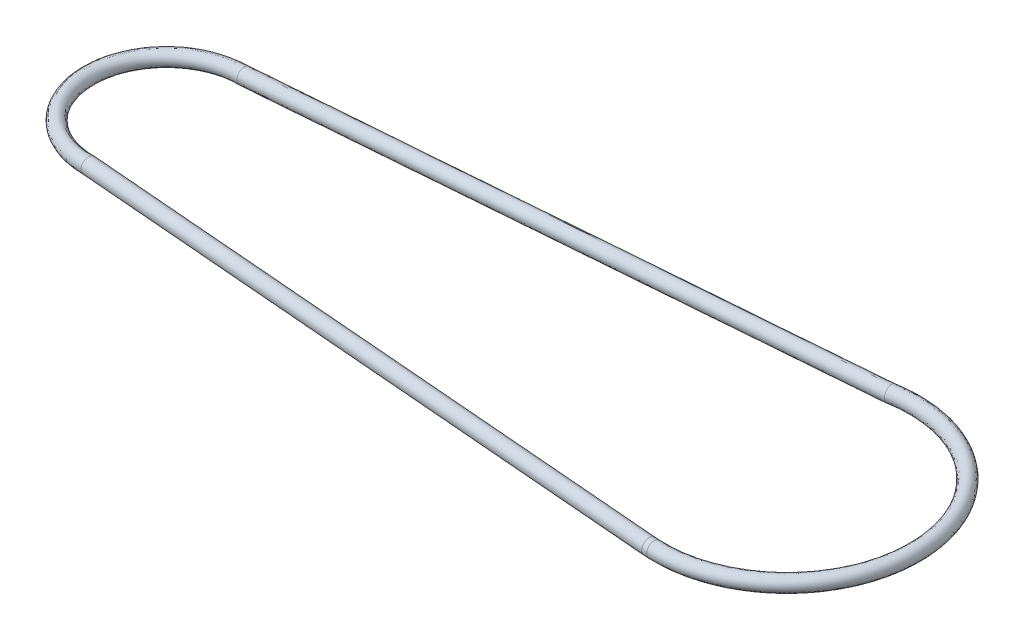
ISO-10303-21;
HEADER;
FILE_DESCRIPTION(('STEP AP214'),'2;1');
FILE_NAME('part.step','',(''),(''),'','','');
FILE_SCHEMA(('AUTOMOTIVE_DESIGN { 1 0 10303 214 1 1 1 1 }'));
ENDSEC;
DATA;
#1=APPLICATION_CONTEXT('core data for automotive mechanical design processes');
#2=APPLICATION_PROTOCOL_DEFINITION('international standard','automotive_design',2000,#1);
#3=PRODUCT_CONTEXT('',#1,'mechanical');
#4=PRODUCT('Part','Part','',(#3));
#5=PRODUCT_RELATED_PRODUCT_CATEGORY('part','',(#4));
#6=PRODUCT_DEFINITION_FORMATION('','',#4);
#7=PRODUCT_DEFINITION_CONTEXT('part definition',#1,'design');
#8=PRODUCT_DEFINITION('design','',#6,#7);
#9=PRODUCT_DEFINITION_SHAPE('','',#8);
#10=(LENGTH_UNIT() NAMED_UNIT(*) SI_UNIT(.MILLI.,.METRE.));
#11=(NAMED_UNIT(*) PLANE_ANGLE_UNIT() SI_UNIT($,.RADIAN.));
#12=(NAMED_UNIT(*) SI_UNIT($,.STERADIAN.) SOLID_ANGLE_UNIT());
#13=UNCERTAINTY_MEASURE_WITH_UNIT(LENGTH_MEASURE(1.E-05),#10,'distance_accuracy_value','');
#14=(GEOMETRIC_REPRESENTATION_CONTEXT(3) GLOBAL_UNCERTAINTY_ASSIGNED_CONTEXT((#13)) GLOBAL_UNIT_ASSIGNED_CONTEXT((#10,
#11,#12)) REPRESENTATION_CONTEXT('',''));
#15=CARTESIAN_POINT('',(0.,0.,0.));
#16=DIRECTION('',(0.,0.,1.));
#17=DIRECTION('',(1.,0.,0.));
#18=AXIS2_PLACEMENT_3D('',#15,#16,#17);
#19=CARTESIAN_POINT('',(-125.45971808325,0.,-8.53024226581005));
#20=CARTESIAN_POINT('',(-2.99510239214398,0.,-18.363837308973));
#21=CARTESIAN_POINT('',(-125.45971808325,3.048,-8.53024226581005));
#22=CARTESIAN_POINT('',(-2.99510239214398,3.048,-18.363837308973));
#23=CARTESIAN_POINT('',(-125.829346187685,3.048,-11.5557470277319));
#24=CARTESIAN_POINT('',(-3.36473049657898,3.048,-21.3893420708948));
#25=CARTESIAN_POINT('',(-125.829346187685,0.,-11.5557470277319));
#26=CARTESIAN_POINT('',(-3.36473049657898,0.,-21.3893420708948));
#27=CARTESIAN_POINT('',(-125.829346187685,-3.048,-11.5557470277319));
#28=CARTESIAN_POINT('',(-3.36473049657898,-3.048,-21.3893420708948));
#29=CARTESIAN_POINT('',(-125.45971808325,-3.048,-8.53024226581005));
#30=CARTESIAN_POINT('',(-2.99510239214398,-3.048,-18.363837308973));
#31=CARTESIAN_POINT('',(-125.45971808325,0.,-8.53024226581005));
#32=CARTESIAN_POINT('',(-2.99510239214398,0.,-18.363837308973));
#33=(BOUNDED_SURFACE() B_SPLINE_SURFACE(3,1,((#19,#20),(#21,#22),(#23,#24),(#25,#26),(#27,#28),
(#29,#30),(#31,#32)),.UNSPECIFIED.,.T.,.F.,.F.) B_SPLINE_SURFACE_WITH_KNOTS((4,3,4),(2,2),(0.,
0.5,1.),(0.,1.),.UNSPECIFIED.) GEOMETRIC_REPRESENTATION_ITEM() RATIONAL_B_SPLINE_SURFACE(((1.,
1.),(0.333333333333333,0.333333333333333),(0.333333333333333,0.333333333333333),(1.,1.),
(0.333333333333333,0.333333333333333),(0.333333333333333,0.333333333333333),(1.,1.))) REPRESENTATION_ITEM('') SURFACE());
#34=CARTESIAN_POINT('',(-3.37893786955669,-1.524,-19.8606087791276));
#35=CARTESIAN_POINT('',(-3.37785955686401,-1.52400050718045,-19.8520989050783));
#36=CARTESIAN_POINT('',(-3.37678110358,-1.52392802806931,-19.8435868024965));
#37=CARTESIAN_POINT('',(-3.36495576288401,-1.52233460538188,-19.750239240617));
#38=CARTESIAN_POINT('',(-3.35421346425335,-1.51365332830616,-19.6653363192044));
#39=CARTESIAN_POINT('',(-3.33836832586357,-1.48998532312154,-19.5400377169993));
#40=CARTESIAN_POINT('',(-3.3331233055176,-1.48029801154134,-19.4985506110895));
#41=CARTESIAN_POINT('',(-3.32275031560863,-1.45742720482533,-19.4164925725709));
#42=CARTESIAN_POINT('',(-3.31762243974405,-1.44424101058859,-19.3759223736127));
#43=CARTESIAN_POINT('',(-3.30249590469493,-1.39962348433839,-19.2562471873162));
#44=CARTESIAN_POINT('',(-3.29272629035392,-1.36309102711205,-19.1789556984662));
#45=CARTESIAN_POINT('',(-3.27408927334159,-1.27744679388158,-19.0315613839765));
#46=CARTESIAN_POINT('',(-3.26522191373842,-1.22833441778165,-18.961458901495));
#47=CARTESIAN_POINT('',(-3.25279036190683,-1.14634372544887,-18.8632240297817));
#48=CARTESIAN_POINT('',(-3.24878927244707,-1.11760659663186,-18.8316152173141));
#49=CARTESIAN_POINT('',(-3.24110702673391,-1.05758244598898,-18.7709393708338));
#50=CARTESIAN_POINT('',(-3.23742556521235,-1.02629791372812,-18.7418699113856));
#51=CARTESIAN_POINT('',(-3.22689317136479,-0.928871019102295,-18.6587234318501));
#52=CARTESIAN_POINT('',(-3.22055185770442,-0.85913968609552,-18.6086895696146));
#53=CARTESIAN_POINT('',(-3.20943265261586,-0.712248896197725,-18.5209878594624));
#54=CARTESIAN_POINT('',(-3.20465442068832,-0.635091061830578,-18.4833173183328));
#55=CARTESIAN_POINT('',(-3.19679359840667,-0.475486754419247,-18.4213578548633));
#56=CARTESIAN_POINT('',(-3.19371097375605,-0.393040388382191,-18.397068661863));
#57=CARTESIAN_POINT('',(-3.18933288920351,-0.225223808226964,-18.3625751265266));
#58=CARTESIAN_POINT('',(-3.18803712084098,-0.13985410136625,-18.3523683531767));
#59=CARTESIAN_POINT('',(-3.18726907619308,0.0314009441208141,-18.3463182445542));
#60=CARTESIAN_POINT('',(-3.1877967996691,0.117286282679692,-18.3504749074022));
#61=CARTESIAN_POINT('',(-3.19066064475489,0.287127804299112,-18.3730358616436));
#62=CARTESIAN_POINT('',(-3.19299658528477,0.371084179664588,-18.3914387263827));
#63=CARTESIAN_POINT('',(-3.19940729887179,0.534683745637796,-18.4419576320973));
#64=CARTESIAN_POINT('',(-3.20348209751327,0.614326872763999,-18.4740738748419));
#65=CARTESIAN_POINT('',(-3.21325704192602,0.767088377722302,-18.5511485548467));
#66=CARTESIAN_POINT('',(-3.21895734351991,0.840206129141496,-18.5961082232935));
#67=CARTESIAN_POINT('',(-3.22859022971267,0.943318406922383,-18.6721238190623));
#68=CARTESIAN_POINT('',(-3.23198220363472,0.976599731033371,-18.6988964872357));
#69=CARTESIAN_POINT('',(-3.23910750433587,1.04080783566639,-18.7551502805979));
#70=CARTESIAN_POINT('',(-3.24284115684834,1.07173231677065,-18.7846339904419));
#71=CARTESIAN_POINT('',(-3.25450904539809,1.1605587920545,-18.8767964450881));
#72=CARTESIAN_POINT('',(-3.26291643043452,1.21458022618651,-18.9432355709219));
#73=CARTESIAN_POINT('',(-3.28074303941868,1.31059520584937,-19.0841755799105));
#74=CARTESIAN_POINT('',(-3.29016223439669,1.35258909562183,-19.1586762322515));
#75=CARTESIAN_POINT('',(-3.3048495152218,1.40569199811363,-19.2748673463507));
#76=CARTESIAN_POINT('',(-3.30984477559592,1.4217584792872,-19.3143885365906));
#77=CARTESIAN_POINT('',(-3.31998241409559,1.45046613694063,-19.3945936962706));
#78=CARTESIAN_POINT('',(-3.32512466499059,1.46311018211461,-19.4352766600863));
#79=CARTESIAN_POINT('',(-3.3407099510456,1.49573350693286,-19.5585630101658));
#80=CARTESIAN_POINT('',(-3.35133831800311,1.51050068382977,-19.6426159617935));
#81=CARTESIAN_POINT('',(-3.36658390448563,1.52126288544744,-19.7630725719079));
#82=CARTESIAN_POINT('',(-3.37114075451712,1.52317029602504,-19.799062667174));
#83=CARTESIAN_POINT('',(-3.37678083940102,1.5239274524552,-19.8435847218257));
#84=CARTESIAN_POINT('',(-3.3778592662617,1.52399985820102,-19.8520966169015));
#85=CARTESIAN_POINT('',(-3.37893786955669,1.524,-19.8606087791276));
#86=B_SPLINE_CURVE_WITH_KNOTS('',3,(#34,#35,#36,#37,#38,#39,#40,#41,#42,#43,#44,#45,#46,#47,#48,
#49,#50,#51,#52,#53,#54,#55,#56,#57,#58,#59,#60,#61,#62,#63,#64,#65,#66,#67,#68,#69,#70,#71,#72,
#73,#74,#75,#76,#77,#78,#79,#80,#81,#82,#83,#84,#85),.UNSPECIFIED.,.F.,.F.,(4,2,2,2,2,2,2,2,2,2,
2,2,2,2,2,2,2,2,2,2,2,2,2,2,2,4),(0.,0.0257398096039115,0.28225162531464,0.410912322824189,
0.539672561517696,0.796519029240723,1.05337775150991,1.18196253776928,1.31042313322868,
1.56727162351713,1.82406412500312,2.08085143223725,2.33759440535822,2.59433734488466,
2.85105457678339,3.10777558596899,3.36452121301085,3.49293361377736,3.62146973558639,
3.87829678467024,4.13511648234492,4.26383992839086,4.39245514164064,4.64899009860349,
4.75790291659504,4.78364272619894),.UNSPECIFIED.);
#87=CARTESIAN_POINT('',(-3.37893786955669,-1.524,-19.8606087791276));
#88=VERTEX_POINT('',#87);
#89=CARTESIAN_POINT('',(-3.37893786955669,1.524,-19.8606087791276));
#90=VERTEX_POINT('',#89);
#91=EDGE_CURVE('E67',#88,#90,#86,.T.);
#92=CARTESIAN_POINT('',(-3.37893786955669,-1.524,-19.8606087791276));
#93=CARTESIAN_POINT('',(-3.38001627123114,-1.52400050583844,-19.8691186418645));
#94=CARTESIAN_POINT('',(-3.38109501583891,-1.52392802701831,-19.8776307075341));
#95=CARTESIAN_POINT('',(-3.39292499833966,-1.52233467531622,-19.970974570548));
#96=CARTESIAN_POINT('',(-3.4036881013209,-1.51365413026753,-20.055871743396));
#97=CARTESIAN_POINT('',(-3.41953750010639,-1.48998787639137,-20.1811653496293));
#98=CARTESIAN_POINT('',(-3.4247794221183,-1.48030126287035,-20.2226513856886));
#99=CARTESIAN_POINT('',(-3.43514051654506,-1.45743198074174,-20.3047080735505));
#100=CARTESIAN_POINT('',(-3.44025959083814,-1.44424661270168,-20.3452779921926));
#101=CARTESIAN_POINT('',(-3.45534899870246,-1.39963153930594,-20.4649540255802));
#102=CARTESIAN_POINT('',(-3.46507954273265,-1.36310073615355,-20.5422480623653));
#103=CARTESIAN_POINT('',(-3.48361350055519,-1.27745952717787,-20.6896504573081));
#104=CARTESIAN_POINT('',(-3.49241687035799,-1.22834852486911,-20.7597584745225));
#105=CARTESIAN_POINT('',(-3.50474071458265,-1.14636110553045,-20.8580012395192));
#106=CARTESIAN_POINT('',(-3.50870383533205,-1.11762607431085,-20.889611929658));
#107=CARTESIAN_POINT('',(-3.51630794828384,-1.05760636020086,-20.9502920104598));
#108=CARTESIAN_POINT('',(-3.51994924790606,-1.02632416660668,-20.9793638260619));
#109=CARTESIAN_POINT('',(-3.53036020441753,-0.928904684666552,-21.0625178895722));
#110=CARTESIAN_POINT('',(-3.53661926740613,-0.859178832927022,-21.1125574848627));
#111=CARTESIAN_POINT('',(-3.54758467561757,-0.712298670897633,-21.2002720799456));
#112=CARTESIAN_POINT('',(-3.55229132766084,-0.63514583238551,-21.2379495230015));
#113=CARTESIAN_POINT('',(-3.56003027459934,-0.475552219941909,-21.2999224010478));
#114=CARTESIAN_POINT('',(-3.56306260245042,-0.393111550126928,-21.3242180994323));
#115=CARTESIAN_POINT('',(-3.56736885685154,-0.225298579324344,-21.3587256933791));
#116=CARTESIAN_POINT('',(-3.56864292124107,-0.139926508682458,-21.3689386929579));
#117=CARTESIAN_POINT('',(-3.56939883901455,0.0313338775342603,-21.3749978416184));
#118=CARTESIAN_POINT('',(-3.56888069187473,0.117222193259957,-21.3708439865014));
#119=CARTESIAN_POINT('',(-3.56606592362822,0.287075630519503,-21.3482844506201));
#120=CARTESIAN_POINT('',(-3.56376937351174,0.371040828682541,-21.3298793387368));
#121=CARTESIAN_POINT('',(-3.55746168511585,0.534658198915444,-21.2793508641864));
#122=CARTESIAN_POINT('',(-3.55345052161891,0.614310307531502,-21.2472272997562));
#123=CARTESIAN_POINT('',(-3.54381793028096,0.767086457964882,-21.170134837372));
#124=CARTESIAN_POINT('',(-3.53819640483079,0.840210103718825,-21.1251651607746));
#125=CARTESIAN_POINT('',(-3.52868363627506,0.943330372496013,-21.0491327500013));
#126=CARTESIAN_POINT('',(-3.52533203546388,0.976614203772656,-21.0223541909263));
#127=CARTESIAN_POINT('',(-3.51828655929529,1.04082693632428,-20.9660882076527));
#128=CARTESIAN_POINT('',(-3.5145923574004,1.07175353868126,-20.9365981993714));
#129=CARTESIAN_POINT('',(-3.5030410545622,1.16056903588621,-20.8444338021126));
#130=CARTESIAN_POINT('',(-3.49470732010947,1.21457952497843,-20.7780015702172));
#131=CARTESIAN_POINT('',(-3.4770067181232,1.31057713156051,-20.6370805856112));
#132=CARTESIAN_POINT('',(-3.46763988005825,1.35256459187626,-20.562592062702));
#133=CARTESIAN_POINT('',(-3.45300910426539,1.40566736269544,-20.4464107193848));
#134=CARTESIAN_POINT('',(-3.4480281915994,1.42173711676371,-20.4068848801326));
#135=CARTESIAN_POINT('',(-3.43791218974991,1.45045058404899,-20.3266708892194));
#136=CARTESIAN_POINT('',(-3.43277723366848,1.46309716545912,-20.2859837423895));
#137=CARTESIAN_POINT('',(-3.4172044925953,1.49572704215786,-20.1626855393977));
#138=CARTESIAN_POINT('',(-3.40657213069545,1.51049718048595,-20.0786256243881));
#139=CARTESIAN_POINT('',(-3.39130486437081,1.52126219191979,-19.9581572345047));
#140=CARTESIAN_POINT('',(-3.3867392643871,1.52317018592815,-19.9221613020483));
#141=CARTESIAN_POINT('',(-3.38109513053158,1.52392745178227,-19.8776328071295));
#142=CARTESIAN_POINT('',(-3.38001639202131,1.52399985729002,-19.8691209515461));
#143=CARTESIAN_POINT('',(-3.37893786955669,1.524,-19.8606087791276));
#144=B_SPLINE_CURVE_WITH_KNOTS('',3,(#92,#93,#94,#95,#96,#97,#98,#99,#100,#101,#102,#103,#104,
#105,#106,#107,#108,#109,#110,#111,#112,#113,#114,#115,#116,#117,#118,#119,#120,#121,#122,#123,
#124,#125,#126,#127,#128,#129,#130,#131,#132,#133,#134,#135,#136,#137,#138,#139,#140,#141,#142,
#143),.UNSPECIFIED.,.F.,.F.,(4,2,2,2,2,2,2,2,2,2,2,2,2,2,2,2,2,2,2,2,2,2,2,2,2,4),(0.,
0.0257398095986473,0.282242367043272,0.410898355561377,0.539653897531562,0.796491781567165,
1.05334184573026,1.18191600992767,1.31036599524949,1.56719331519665,1.82396984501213,
2.08074132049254,2.33749266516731,2.59424408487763,2.85098525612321,3.10773020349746,
3.36449071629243,3.49291043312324,3.62145383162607,3.8782234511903,4.13498574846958,
4.26372063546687,4.39234732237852,4.64890528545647,4.75783880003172,4.78357860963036),.UNSPECIFIED.);
#145=EDGE_CURVE('E39',#88,#90,#144,.T.);
#146=CARTESIAN_POINT('',(-125.408090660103,-1.524,-10.0619802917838));
#147=CARTESIAN_POINT('',(-125.408458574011,-1.52400058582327,-10.0711581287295));
#148=CARTESIAN_POINT('',(-125.408826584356,-1.52391743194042,-10.0803385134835));
#149=CARTESIAN_POINT('',(-125.412618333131,-1.5221999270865,-10.1749289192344));
#150=CARTESIAN_POINT('',(-125.416043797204,-1.51341863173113,-10.2603940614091));
#151=CARTESIAN_POINT('',(-125.421097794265,-1.48960677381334,-10.3865085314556));
#152=CARTESIAN_POINT('',(-125.422770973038,-1.47987261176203,-10.4282630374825));
#153=CARTESIAN_POINT('',(-125.426079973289,-1.45691070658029,-10.5108452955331));
#154=CARTESIAN_POINT('',(-125.427715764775,-1.44368025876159,-10.5516723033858));
#155=CARTESIAN_POINT('',(-125.432540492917,-1.39893466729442,-10.6720983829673));
#156=CARTESIAN_POINT('',(-125.435655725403,-1.36232287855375,-10.749865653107));
#157=CARTESIAN_POINT('',(-125.441595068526,-1.2765353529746,-10.8981495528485));
#158=CARTESIAN_POINT('',(-125.444419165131,-1.22735901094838,-10.9686658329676));
#159=CARTESIAN_POINT('',(-125.448375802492,-1.14528295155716,-11.0674706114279));
#160=CARTESIAN_POINT('',(-125.449648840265,-1.11651740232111,-11.0992624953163));
#161=CARTESIAN_POINT('',(-125.452092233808,-1.05644061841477,-11.1602847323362));
#162=CARTESIAN_POINT('',(-125.453262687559,-1.0251318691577,-11.1895175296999));
#163=CARTESIAN_POINT('',(-125.456610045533,-0.927638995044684,-11.2731232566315));
#164=CARTESIAN_POINT('',(-125.458623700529,-0.857872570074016,-11.3234223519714));
#165=CARTESIAN_POINT('',(-125.462152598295,-0.710914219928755,-11.4115758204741));
#166=CARTESIAN_POINT('',(-125.463667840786,-0.633722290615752,-11.4494301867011));
#167=CARTESIAN_POINT('',(-125.46615869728,-0.474065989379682,-11.5116600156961));
#168=CARTESIAN_POINT('',(-125.467134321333,-0.391601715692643,-11.5360357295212));
#169=CARTESIAN_POINT('',(-125.468518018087,-0.22374581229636,-11.5706075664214));
#170=CARTESIAN_POINT('',(-125.468926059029,-0.138354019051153,-11.5808028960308));
#171=CARTESIAN_POINT('',(-125.469163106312,0.0329306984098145,-11.58672573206));
#172=CARTESIAN_POINT('',(-125.468992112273,0.118823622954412,-11.5824532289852));
#173=CARTESIAN_POINT('',(-125.468075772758,0.288675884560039,-11.5595579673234));
#174=CARTESIAN_POINT('',(-125.467330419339,0.372635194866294,-11.5409350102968));
#175=CARTESIAN_POINT('',(-125.465286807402,0.536225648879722,-11.4898770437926));
#176=CARTESIAN_POINT('',(-125.46398854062,0.615856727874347,-11.4574418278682));
#177=CARTESIAN_POINT('',(-125.460874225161,0.768573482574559,-11.3796407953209));
#178=CARTESIAN_POINT('',(-125.459058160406,0.841658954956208,-11.3342745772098));
#179=CARTESIAN_POINT('',(-125.455988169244,0.944711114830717,-11.2575913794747));
#180=CARTESIAN_POINT('',(-125.454906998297,0.97797040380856,-11.2305865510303));
#181=CARTESIAN_POINT('',(-125.452635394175,1.04213047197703,-11.1738504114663));
#182=CARTESIAN_POINT('',(-125.45144485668,1.07302894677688,-11.1441164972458));
#183=CARTESIAN_POINT('',(-125.447724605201,1.16174486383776,-11.0512071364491));
#184=CARTESIAN_POINT('',(-125.445043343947,1.21568022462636,-10.9842514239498));
#185=CARTESIAN_POINT('',(-125.439355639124,1.31151732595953,-10.8422366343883));
#186=CARTESIAN_POINT('',(-125.436349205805,1.35341944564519,-10.7671778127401));
#187=CARTESIAN_POINT('',(-125.431660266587,1.40638183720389,-10.650128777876));
#188=CARTESIAN_POINT('',(-125.430065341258,1.42240103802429,-10.6103174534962));
#189=CARTESIAN_POINT('',(-125.426828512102,1.45101325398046,-10.5295275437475));
#190=CARTESIAN_POINT('',(-125.425186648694,1.46360912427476,-10.4885499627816));
#191=CARTESIAN_POINT('',(-125.420211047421,1.49608643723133,-10.3643776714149));
#192=CARTESIAN_POINT('',(-125.416818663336,1.51075489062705,-10.2797278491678));
#193=CARTESIAN_POINT('',(-125.412004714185,1.52127131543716,-10.1596233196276));
#194=CARTESIAN_POINT('',(-125.41060014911,1.52311645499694,-10.1245825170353));
#195=CARTESIAN_POINT('',(-125.408826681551,1.52391676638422,-10.0803409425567));
#196=CARTESIAN_POINT('',(-125.408458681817,1.52399982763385,-10.0711608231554));
#197=CARTESIAN_POINT('',(-125.408090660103,1.524,-10.0619802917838));
#198=B_SPLINE_CURVE_WITH_KNOTS('',3,(#146,#147,#148,#149,#150,#151,#152,#153,#154,#155,#156,
#157,#158,#159,#160,#161,#162,#163,#164,#165,#166,#167,#168,#169,#170,#171,#172,#173,#174,#175,
#176,#177,#178,#179,#180,#181,#182,#183,#184,#185,#186,#187,#188,#189,#190,#191,#192,#193,#194,
#195,#196,#197),.UNSPECIFIED.,.F.,.F.,(4,2,2,2,2,2,2,2,2,2,2,2,2,2,2,2,2,2,2,2,2,2,2,2,2,4),(0.,
0.0275624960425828,0.283971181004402,0.412577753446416,0.541284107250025,0.798023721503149,
1.05477570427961,1.18332046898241,1.3117410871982,1.56850972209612,1.82527850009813,
2.08204249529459,2.33882085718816,2.59559938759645,2.85238146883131,3.10916738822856,
3.36596128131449,3.4943974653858,3.62295745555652,3.87971743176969,4.13646931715,
4.26516092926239,4.39374487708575,4.6502113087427,4.7555022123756,4.78306470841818),.UNSPECIFIED.);
#199=CARTESIAN_POINT('',(-125.408090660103,-1.524,-10.0619802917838));
#200=VERTEX_POINT('',#199);
#201=CARTESIAN_POINT('',(-125.408090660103,1.524,-10.0619802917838));
#202=VERTEX_POINT('',#201);
#203=EDGE_CURVE('E75',#200,#202,#198,.T.);
#204=CARTESIAN_POINT('',(-125.408090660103,-1.524,-10.0619802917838));
#205=CARTESIAN_POINT('',(-125.407722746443,-1.52400058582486,-10.0528024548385));
#206=CARTESIAN_POINT('',(-125.407354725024,-1.5239174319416,-10.0436220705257));
#207=CARTESIAN_POINT('',(-125.403562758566,-1.52219993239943,-9.94903198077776));
#208=CARTESIAN_POINT('',(-125.400136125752,-1.51341869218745,-9.86356719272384));
#209=CARTESIAN_POINT('',(-125.395079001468,-1.48960696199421,-9.73745329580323));
#210=CARTESIAN_POINT('',(-125.393404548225,-1.47987285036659,-9.69569898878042));
#211=CARTESIAN_POINT('',(-125.390092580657,-1.45691105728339,-9.61311714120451));
#212=CARTESIAN_POINT('',(-125.388455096,-1.44368067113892,-9.57229034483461));
#213=CARTESIAN_POINT('',(-125.383624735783,-1.39893527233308,-9.4518649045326));
#214=CARTESIAN_POINT('',(-125.380505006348,-1.36232362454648,-9.37409807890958));
#215=CARTESIAN_POINT('',(-125.37455568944,-1.27653639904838,-9.22581509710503));
#216=CARTESIAN_POINT('',(-125.371726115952,-1.22736021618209,-9.15529929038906));
#217=CARTESIAN_POINT('',(-125.36776100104,-1.14528446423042,-9.05649527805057));
#218=CARTESIAN_POINT('',(-125.366485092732,-1.11651905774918,-9.02470368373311));
#219=CARTESIAN_POINT('',(-125.364035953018,-1.05644257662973,-8.96368200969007));
#220=CARTESIAN_POINT('',(-125.362862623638,-1.02513398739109,-8.93444948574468));
#221=CARTESIAN_POINT('',(-125.359506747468,-0.927641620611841,-8.85084454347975));
#222=CARTESIAN_POINT('',(-125.357487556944,-0.857875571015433,-8.80054592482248));
#223=CARTESIAN_POINT('',(-125.353948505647,-0.710917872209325,-8.7123931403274));
#224=CARTESIAN_POINT('',(-125.352428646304,-0.633726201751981,-8.67453901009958));
#225=CARTESIAN_POINT('',(-125.349929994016,-0.474070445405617,-8.61230947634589));
#226=CARTESIAN_POINT('',(-125.34895119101,-0.391606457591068,-8.58793382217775));
#227=CARTESIAN_POINT('',(-125.347562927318,-0.223750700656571,-8.55336179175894));
#228=CARTESIAN_POINT('',(-125.347153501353,-0.138358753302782,-8.54316628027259));
#229=CARTESIAN_POINT('',(-125.346915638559,0.0329263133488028,-8.53724298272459));
#230=CARTESIAN_POINT('',(-125.347087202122,0.118819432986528,-8.5415152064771));
#231=CARTESIAN_POINT('',(-125.348006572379,0.288672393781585,-8.5644098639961));
#232=CARTESIAN_POINT('',(-125.348754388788,0.372632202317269,-8.58303253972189));
#233=CARTESIAN_POINT('',(-125.350804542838,0.536223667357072,-8.63408998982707));
#234=CARTESIAN_POINT('',(-125.352106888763,0.615855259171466,-8.66652497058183));
#235=CARTESIAN_POINT('',(-125.355230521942,0.76857287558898,-8.74432555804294));
#236=CARTESIAN_POINT('',(-125.357051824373,0.841658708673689,-8.78969154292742));
#237=CARTESIAN_POINT('',(-125.360130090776,0.944711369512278,-8.86637446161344));
#238=CARTESIAN_POINT('',(-125.361214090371,0.977970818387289,-8.89337920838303));
#239=CARTESIAN_POINT('',(-125.363491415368,1.04213118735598,-8.95011521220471));
#240=CARTESIAN_POINT('',(-125.364684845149,1.07302980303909,-8.97984907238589));
#241=CARTESIAN_POINT('',(-125.368413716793,1.16174560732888,-9.07275779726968));
#242=CARTESIAN_POINT('',(-125.371100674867,1.21568076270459,-9.13971288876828));
#243=CARTESIAN_POINT('',(-125.376799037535,1.31151751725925,-9.28172643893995));
#244=CARTESIAN_POINT('',(-125.379810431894,1.35341949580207,-9.35678464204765));
#245=CARTESIAN_POINT('',(-125.384505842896,1.40638172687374,-9.47383277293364));
#246=CARTESIAN_POINT('',(-125.386102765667,1.42240088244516,-9.51364379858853));
#247=CARTESIAN_POINT('',(-125.389343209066,1.45101302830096,-9.5944331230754));
#248=CARTESIAN_POINT('',(-125.390986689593,1.46360887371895,-9.63541041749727));
#249=CARTESIAN_POINT('',(-125.395966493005,1.49608614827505,-9.75958187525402));
#250=CARTESIAN_POINT('',(-125.399360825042,1.51075462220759,-9.84423117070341));
#251=CARTESIAN_POINT('',(-125.40417618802,1.52127124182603,-9.96433589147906));
#252=CARTESIAN_POINT('',(-125.405581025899,1.52311644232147,-9.9993773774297));
#253=CARTESIAN_POINT('',(-125.407354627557,1.52391676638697,-10.0436196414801));
#254=CARTESIAN_POINT('',(-125.407722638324,1.52399982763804,-10.0527997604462));
#255=CARTESIAN_POINT('',(-125.408090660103,1.524,-10.0619802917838));
#256=B_SPLINE_CURVE_WITH_KNOTS('',3,(#204,#205,#206,#207,#208,#209,#210,#211,#212,#213,#214,
#215,#216,#217,#218,#219,#220,#221,#222,#223,#224,#225,#226,#227,#228,#229,#230,#231,#232,#233,
#234,#235,#236,#237,#238,#239,#240,#241,#242,#243,#244,#245,#246,#247,#248,#249,#250,#251,#252,
#253,#254,#255),.UNSPECIFIED.,.F.,.F.,(4,2,2,2,2,2,2,2,2,2,2,2,2,2,2,2,2,2,2,2,2,2,2,2,2,4),(0.,
0.0275624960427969,0.283970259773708,0.412576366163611,0.541282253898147,0.79802097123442,
1.05477205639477,1.1833161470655,1.31173609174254,1.56850338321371,1.82527140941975,
2.08203466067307,2.33881356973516,2.59559265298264,2.8523760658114,3.10916331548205,
3.36595807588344,3.49439469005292,3.62295511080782,3.87971379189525,4.13646437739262,
4.26515533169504,4.39373862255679,4.65020375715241,4.75549674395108,4.78305923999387),.UNSPECIFIED.);
#257=EDGE_CURVE('E77',#200,#202,#256,.T.);
#258=ORIENTED_EDGE('',*,*,#91,.T.);
#259=ORIENTED_EDGE('',*,*,#145,.F.);
#260=EDGE_LOOP('',(#258,#259));
#261=FACE_BOUND('',#260,.T.);
#262=ORIENTED_EDGE('',*,*,#203,.T.);
#263=ORIENTED_EDGE('',*,*,#257,.F.);
#264=EDGE_LOOP('',(#262,#263));
#265=FACE_BOUND('',#264,.T.);
#266=ADVANCED_FACE('F34',(#261,#265),#33,.F.);
#267=CARTESIAN_POINT('',(-3.29944069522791,0.,-18.3288881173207));
#268=CARTESIAN_POINT('',(-3.21609647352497,0.,-18.3433820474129));
#269=CARTESIAN_POINT('',(-3.13021893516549,0.,-18.3584263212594));
#270=CARTESIAN_POINT('',(-2.61388097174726,0.,-18.4475182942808));
#271=CARTESIAN_POINT('',(-2.20381985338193,0.,-18.5056792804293));
#272=CARTESIAN_POINT('',(-1.35380160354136,0.,-18.6056263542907));
#273=CARTESIAN_POINT('',(-0.927499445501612,0.,-18.6444541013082));
#274=CARTESIAN_POINT('',(0.353572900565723,0.,-18.7273486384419));
#275=CARTESIAN_POINT('',(1.21051433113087,0.,-18.7377947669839));
#276=CARTESIAN_POINT('',(3.77587336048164,0.,-18.6345203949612));
#277=CARTESIAN_POINT('',(5.47850735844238,0.,-18.3857534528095));
#278=CARTESIAN_POINT('',(10.4538239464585,0.,-17.1157458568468));
#279=CARTESIAN_POINT('',(13.5889010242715,0.,-15.5639367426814));
#280=CARTESIAN_POINT('',(18.9581715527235,0.,-11.3159891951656));
#281=CARTESIAN_POINT('',(21.1896201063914,0.,-8.6220224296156));
#282=CARTESIAN_POINT('',(24.3637233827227,0.,-2.55578860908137));
#283=CARTESIAN_POINT('',(25.3047554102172,0.,0.813377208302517));
#284=CARTESIAN_POINT('',(25.7335083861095,0.,7.64640693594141));
#285=CARTESIAN_POINT('',(25.2210101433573,0.,11.1067776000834));
#286=CARTESIAN_POINT('',(22.8300949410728,0.,17.5222003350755));
#287=CARTESIAN_POINT('',(20.9529002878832,0.,20.4739726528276));
#288=CARTESIAN_POINT('',(16.1567460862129,0.,25.3597713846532));
#289=CARTESIAN_POINT('',(13.2402384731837,0.,27.2913000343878));
#290=CARTESIAN_POINT('',(6.87018644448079,0.,29.8005950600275));
#291=CARTESIAN_POINT('',(3.41989874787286,0.,30.3770786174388));
#292=CARTESIAN_POINT('',(0.,0.,30.226));
#293=CARTESIAN_POINT('',(-3.29944069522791,3.048,-18.3288881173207));
#294=CARTESIAN_POINT('',(-3.21609647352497,3.048,-18.3433820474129));
#295=CARTESIAN_POINT('',(-3.13021893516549,3.048,-18.3584263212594));
#296=CARTESIAN_POINT('',(-2.61388097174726,3.048,-18.4475182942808));
#297=CARTESIAN_POINT('',(-2.20381985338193,3.048,-18.5056792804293));
#298=CARTESIAN_POINT('',(-1.35380160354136,3.048,-18.6056263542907));
#299=CARTESIAN_POINT('',(-0.927499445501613,3.048,-18.6444541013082));
#300=CARTESIAN_POINT('',(0.353572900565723,3.048,-18.7273486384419));
#301=CARTESIAN_POINT('',(1.21051433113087,3.048,-18.7377947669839));
#302=CARTESIAN_POINT('',(3.77587336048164,3.048,-18.6345203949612));
#303=CARTESIAN_POINT('',(5.47850735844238,3.048,-18.3857534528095));
#304=CARTESIAN_POINT('',(10.4538239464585,3.048,-17.1157458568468));
#305=CARTESIAN_POINT('',(13.5889010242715,3.048,-15.5639367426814));
#306=CARTESIAN_POINT('',(18.9581715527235,3.048,-11.3159891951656));
#307=CARTESIAN_POINT('',(21.1896201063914,3.048,-8.6220224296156));
#308=CARTESIAN_POINT('',(24.3637233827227,3.048,-2.55578860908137));
#309=CARTESIAN_POINT('',(25.3047554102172,3.048,0.813377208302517));
#310=CARTESIAN_POINT('',(25.7335083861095,3.048,7.64640693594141));
#311=CARTESIAN_POINT('',(25.2210101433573,3.048,11.1067776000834));
#312=CARTESIAN_POINT('',(22.8300949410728,3.048,17.5222003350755));
#313=CARTESIAN_POINT('',(20.9529002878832,3.048,20.4739726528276));
#314=CARTESIAN_POINT('',(16.1567460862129,3.048,25.3597713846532));
#315=CARTESIAN_POINT('',(13.2402384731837,3.048,27.2913000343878));
#316=CARTESIAN_POINT('',(6.87018644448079,3.048,29.8005950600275));
#317=CARTESIAN_POINT('',(3.41989874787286,3.048,30.3770786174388));
#318=CARTESIAN_POINT('',(0.,3.048,30.226));
#319=CARTESIAN_POINT('',(-3.94562918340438,3.048,-21.3076033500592));
#320=CARTESIAN_POINT('',(-3.86228496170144,3.048,-21.3220972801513));
#321=CARTESIAN_POINT('',(-3.78123775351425,3.048,-21.3360937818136));
#322=CARTESIAN_POINT('',(-3.23403659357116,3.048,-21.4318804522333));
#323=CARTESIAN_POINT('',(-2.74558727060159,3.048,-21.5056175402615));
#324=CARTESIAN_POINT('',(-1.79041376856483,3.048,-21.6226631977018));
#325=CARTESIAN_POINT('',(-1.31131195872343,3.048,-21.668661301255));
#326=CARTESIAN_POINT('',(0.128613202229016,3.048,-21.7689018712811));
#327=CARTESIAN_POINT('',(1.09206249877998,3.048,-21.7853546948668));
#328=CARTESIAN_POINT('',(3.97700499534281,3.048,-21.6833305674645));
#329=CARTESIAN_POINT('',(5.89273725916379,3.048,-21.4129816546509));
#330=CARTESIAN_POINT('',(11.4937379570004,3.048,-20.0123740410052));
#331=CARTESIAN_POINT('',(15.0272036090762,3.048,-18.2848119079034));
#332=CARTESIAN_POINT('',(21.0875080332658,3.048,-13.5381057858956));
#333=CARTESIAN_POINT('',(23.6112486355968,3.048,-10.5213884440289));
#334=CARTESIAN_POINT('',(27.2133938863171,3.048,-3.71822312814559));
#335=CARTESIAN_POINT('',(28.289957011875,3.048,0.0647468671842));
#336=CARTESIAN_POINT('',(28.8095654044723,3.048,7.74514502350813));
#337=CARTESIAN_POINT('',(28.2523450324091,3.048,11.6386467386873));
#338=CARTESIAN_POINT('',(25.5993502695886,3.048,18.8649962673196));
#339=CARTESIAN_POINT('',(23.5049321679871,3.048,22.1941497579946));
#340=CARTESIAN_POINT('',(18.1391909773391,3.048,27.7138716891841));
#341=CARTESIAN_POINT('',(14.8706110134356,3.048,29.9016182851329));
#342=CARTESIAN_POINT('',(7.72219390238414,3.048,32.7579518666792));
#343=CARTESIAN_POINT('',(3.84601141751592,3.048,33.4250786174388));
#344=CARTESIAN_POINT('',(0.,3.048,33.274));
#345=CARTESIAN_POINT('',(-3.94562918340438,0.,-21.3076033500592));
#346=CARTESIAN_POINT('',(-3.86228496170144,0.,-21.3220972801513));
#347=CARTESIAN_POINT('',(-3.78123775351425,0.,-21.3360937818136));
#348=CARTESIAN_POINT('',(-3.23403659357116,0.,-21.4318804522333));
#349=CARTESIAN_POINT('',(-2.74558727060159,0.,-21.5056175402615));
#350=CARTESIAN_POINT('',(-1.79041376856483,0.,-21.6226631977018));
#351=CARTESIAN_POINT('',(-1.31131195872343,0.,-21.668661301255));
#352=CARTESIAN_POINT('',(0.128613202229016,0.,-21.7689018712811));
#353=CARTESIAN_POINT('',(1.09206249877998,0.,-21.7853546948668));
#354=CARTESIAN_POINT('',(3.97700499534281,0.,-21.6833305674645));
#355=CARTESIAN_POINT('',(5.89273725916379,0.,-21.4129816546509));
#356=CARTESIAN_POINT('',(11.4937379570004,0.,-20.0123740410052));
#357=CARTESIAN_POINT('',(15.0272036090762,0.,-18.2848119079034));
#358=CARTESIAN_POINT('',(21.0875080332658,0.,-13.5381057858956));
#359=CARTESIAN_POINT('',(23.6112486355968,0.,-10.5213884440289));
#360=CARTESIAN_POINT('',(27.2133938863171,0.,-3.71822312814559));
#361=CARTESIAN_POINT('',(28.289957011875,0.,0.0647468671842));
#362=CARTESIAN_POINT('',(28.8095654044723,0.,7.74514502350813));
#363=CARTESIAN_POINT('',(28.2523450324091,0.,11.6386467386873));
#364=CARTESIAN_POINT('',(25.5993502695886,0.,18.8649962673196));
#365=CARTESIAN_POINT('',(23.5049321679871,0.,22.1941497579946));
#366=CARTESIAN_POINT('',(18.1391909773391,0.,27.7138716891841));
#367=CARTESIAN_POINT('',(14.8706110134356,0.,29.9016182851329));
#368=CARTESIAN_POINT('',(7.72219390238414,0.,32.7579518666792));
#369=CARTESIAN_POINT('',(3.84601141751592,0.,33.4250786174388));
#370=CARTESIAN_POINT('',(0.,0.,33.274));
#371=CARTESIAN_POINT('',(-3.94562918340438,-3.048,-21.3076033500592));
#372=CARTESIAN_POINT('',(-3.86228496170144,-3.048,-21.3220972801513));
#373=CARTESIAN_POINT('',(-3.78123775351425,-3.048,-21.3360937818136));
#374=CARTESIAN_POINT('',(-3.23403659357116,-3.048,-21.4318804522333));
#375=CARTESIAN_POINT('',(-2.74558727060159,-3.048,-21.5056175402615));
#376=CARTESIAN_POINT('',(-1.79041376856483,-3.048,-21.6226631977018));
#377=CARTESIAN_POINT('',(-1.31131195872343,-3.048,-21.668661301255));
#378=CARTESIAN_POINT('',(0.128613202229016,-3.048,-21.7689018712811));
#379=CARTESIAN_POINT('',(1.09206249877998,-3.048,-21.7853546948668));
#380=CARTESIAN_POINT('',(3.97700499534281,-3.048,-21.6833305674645));
#381=CARTESIAN_POINT('',(5.89273725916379,-3.048,-21.4129816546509));
#382=CARTESIAN_POINT('',(11.4937379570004,-3.048,-20.0123740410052));
#383=CARTESIAN_POINT('',(15.0272036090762,-3.048,-18.2848119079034));
#384=CARTESIAN_POINT('',(21.0875080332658,-3.048,-13.5381057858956));
#385=CARTESIAN_POINT('',(23.6112486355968,-3.048,-10.5213884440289));
#386=CARTESIAN_POINT('',(27.2133938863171,-3.048,-3.71822312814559));
#387=CARTESIAN_POINT('',(28.289957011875,-3.048,0.0647468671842));
#388=CARTESIAN_POINT('',(28.8095654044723,-3.048,7.74514502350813));
#389=CARTESIAN_POINT('',(28.2523450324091,-3.048,11.6386467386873));
#390=CARTESIAN_POINT('',(25.5993502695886,-3.048,18.8649962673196));
#391=CARTESIAN_POINT('',(23.5049321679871,-3.048,22.1941497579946));
#392=CARTESIAN_POINT('',(18.1391909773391,-3.048,27.7138716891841));
#393=CARTESIAN_POINT('',(14.8706110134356,-3.048,29.9016182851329));
#394=CARTESIAN_POINT('',(7.72219390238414,-3.048,32.7579518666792));
#395=CARTESIAN_POINT('',(3.84601141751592,-3.048,33.4250786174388));
#396=CARTESIAN_POINT('',(0.,-3.048,33.274));
#397=CARTESIAN_POINT('',(-3.29944069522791,-3.048,-18.3288881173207));
#398=CARTESIAN_POINT('',(-3.21609647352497,-3.048,-18.3433820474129));
#399=CARTESIAN_POINT('',(-3.13021893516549,-3.048,-18.3584263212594));
#400=CARTESIAN_POINT('',(-2.61388097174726,-3.048,-18.4475182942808));
#401=CARTESIAN_POINT('',(-2.20381985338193,-3.048,-18.5056792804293));
#402=CARTESIAN_POINT('',(-1.35380160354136,-3.048,-18.6056263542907));
#403=CARTESIAN_POINT('',(-0.927499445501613,-3.048,-18.6444541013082));
#404=CARTESIAN_POINT('',(0.353572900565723,-3.048,-18.7273486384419));
#405=CARTESIAN_POINT('',(1.21051433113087,-3.048,-18.7377947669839));
#406=CARTESIAN_POINT('',(3.77587336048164,-3.048,-18.6345203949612));
#407=CARTESIAN_POINT('',(5.47850735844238,-3.048,-18.3857534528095));
#408=CARTESIAN_POINT('',(10.4538239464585,-3.048,-17.1157458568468));
#409=CARTESIAN_POINT('',(13.5889010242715,-3.048,-15.5639367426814));
#410=CARTESIAN_POINT('',(18.9581715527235,-3.048,-11.3159891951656));
#411=CARTESIAN_POINT('',(21.1896201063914,-3.048,-8.6220224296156));
#412=CARTESIAN_POINT('',(24.3637233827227,-3.048,-2.55578860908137));
#413=CARTESIAN_POINT('',(25.3047554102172,-3.048,0.813377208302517));
#414=CARTESIAN_POINT('',(25.7335083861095,-3.048,7.64640693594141));
#415=CARTESIAN_POINT('',(25.2210101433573,-3.048,11.1067776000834));
#416=CARTESIAN_POINT('',(22.8300949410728,-3.048,17.5222003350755));
#417=CARTESIAN_POINT('',(20.9529002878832,-3.048,20.4739726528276));
#418=CARTESIAN_POINT('',(16.1567460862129,-3.048,25.3597713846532));
#419=CARTESIAN_POINT('',(13.2402384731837,-3.048,27.2913000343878));
#420=CARTESIAN_POINT('',(6.87018644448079,-3.048,29.8005950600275));
#421=CARTESIAN_POINT('',(3.41989874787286,-3.048,30.3770786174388));
#422=CARTESIAN_POINT('',(0.,-3.048,30.226));
#423=CARTESIAN_POINT('',(-3.29944069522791,0.,-18.3288881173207));
#424=CARTESIAN_POINT('',(-3.21609647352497,0.,-18.3433820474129));
#425=CARTESIAN_POINT('',(-3.13021893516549,0.,-18.3584263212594));
#426=CARTESIAN_POINT('',(-2.61388097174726,0.,-18.4475182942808));
#427=CARTESIAN_POINT('',(-2.20381985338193,0.,-18.5056792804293));
#428=CARTESIAN_POINT('',(-1.35380160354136,0.,-18.6056263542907));
#429=CARTESIAN_POINT('',(-0.927499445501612,0.,-18.6444541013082));
#430=CARTESIAN_POINT('',(0.353572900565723,0.,-18.7273486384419));
#431=CARTESIAN_POINT('',(1.21051433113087,0.,-18.7377947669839));
#432=CARTESIAN_POINT('',(3.77587336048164,0.,-18.6345203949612));
#433=CARTESIAN_POINT('',(5.47850735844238,0.,-18.3857534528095));
#434=CARTESIAN_POINT('',(10.4538239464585,0.,-17.1157458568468));
#435=CARTESIAN_POINT('',(13.5889010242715,0.,-15.5639367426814));
#436=CARTESIAN_POINT('',(18.9581715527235,0.,-11.3159891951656));
#437=CARTESIAN_POINT('',(21.1896201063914,0.,-8.6220224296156));
#438=CARTESIAN_POINT('',(24.3637233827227,0.,-2.55578860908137));
#439=CARTESIAN_POINT('',(25.3047554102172,0.,0.813377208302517));
#440=CARTESIAN_POINT('',(25.7335083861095,0.,7.64640693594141));
#441=CARTESIAN_POINT('',(25.2210101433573,0.,11.1067776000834));
#442=CARTESIAN_POINT('',(22.8300949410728,0.,17.5222003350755));
#443=CARTESIAN_POINT('',(20.9529002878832,0.,20.4739726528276));
#444=CARTESIAN_POINT('',(16.1567460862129,0.,25.3597713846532));
#445=CARTESIAN_POINT('',(13.2402384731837,0.,27.2913000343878));
#446=CARTESIAN_POINT('',(6.87018644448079,0.,29.8005950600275));
#447=CARTESIAN_POINT('',(3.41989874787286,0.,30.3770786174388));
#448=CARTESIAN_POINT('',(0.,0.,30.226));
#449=(BOUNDED_SURFACE() B_SPLINE_SURFACE(3,3,((#267,#268,#269,#270,#271,#272,#273,#274,#275,
#276,#277,#278,#279,#280,#281,#282,#283,#284,#285,#286,#287,#288,#289,#290,#291,#292),(#293,
#294,#295,#296,#297,#298,#299,#300,#301,#302,#303,#304,#305,#306,#307,#308,#309,#310,#311,#312,
#313,#314,#315,#316,#317,#318),(#319,#320,#321,#322,#323,#324,#325,#326,#327,#328,#329,#330,
#331,#332,#333,#334,#335,#336,#337,#338,#339,#340,#341,#342,#343,#344),(#345,#346,#347,#348,
#349,#350,#351,#352,#353,#354,#355,#356,#357,#358,#359,#360,#361,#362,#363,#364,#365,#366,#367,
#368,#369,#370),(#371,#372,#373,#374,#375,#376,#377,#378,#379,#380,#381,#382,#383,#384,#385,
#386,#387,#388,#389,#390,#391,#392,#393,#394,#395,#396),(#397,#398,#399,#400,#401,#402,#403,
#404,#405,#406,#407,#408,#409,#410,#411,#412,#413,#414,#415,#416,#417,#418,#419,#420,#421,#422),
(#423,#424,#425,#426,#427,#428,#429,#430,#431,#432,#433,#434,#435,#436,#437,#438,#439,#440,#441,
#442,#443,#444,#445,#446,#447,#448)),.UNSPECIFIED.,.T.,.F.,.F.) B_SPLINE_SURFACE_WITH_KNOTS((4,
3,4),(4,2,2,2,2,2,2,2,2,2,2,2,4),(0.,0.5,1.),(-0.00118930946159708,0.,0.00640973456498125,
0.0128194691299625,0.025638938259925,0.05127787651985,0.1025557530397,0.15383362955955,
0.2051115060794,0.25638938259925,0.3076672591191,0.35894513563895,0.4102230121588),
.UNSPECIFIED.) GEOMETRIC_REPRESENTATION_ITEM() RATIONAL_B_SPLINE_SURFACE(((1.,1.,1.,1.,1.,1.,1.,
1.,1.,1.,1.,1.,1.,1.,1.,1.,1.,1.,1.,1.,1.,1.,1.,1.,1.,1.),(0.333333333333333,0.333333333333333,
0.333333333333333,0.333333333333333,0.333333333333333,0.333333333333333,0.333333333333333,
0.333333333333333,0.333333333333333,0.333333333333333,0.333333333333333,0.333333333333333,
0.333333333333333,0.333333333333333,0.333333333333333,0.333333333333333,0.333333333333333,
0.333333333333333,0.333333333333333,0.333333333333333,0.333333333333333,0.333333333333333,
0.333333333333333,0.333333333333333,0.333333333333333,0.333333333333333),(0.333333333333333,
0.333333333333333,0.333333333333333,0.333333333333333,0.333333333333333,0.333333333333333,
0.333333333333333,0.333333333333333,0.333333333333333,0.333333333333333,0.333333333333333,
0.333333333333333,0.333333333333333,0.333333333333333,0.333333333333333,0.333333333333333,
0.333333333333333,0.333333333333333,0.333333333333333,0.333333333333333,0.333333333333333,
0.333333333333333,0.333333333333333,0.333333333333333,0.333333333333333,0.333333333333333),(1.,
1.,1.,1.,1.,1.,1.,1.,1.,1.,1.,1.,1.,1.,1.,1.,1.,1.,1.,1.,1.,1.,1.,1.,1.,1.),(0.333333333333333,
0.333333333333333,0.333333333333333,0.333333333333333,0.333333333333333,0.333333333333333,
0.333333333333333,0.333333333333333,0.333333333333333,0.333333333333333,0.333333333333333,
0.333333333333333,0.333333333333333,0.333333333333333,0.333333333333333,0.333333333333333,
0.333333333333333,0.333333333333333,0.333333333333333,0.333333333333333,0.333333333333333,
0.333333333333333,0.333333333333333,0.333333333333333,0.333333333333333,0.333333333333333),
(0.333333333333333,0.333333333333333,0.333333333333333,0.333333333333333,0.333333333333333,
0.333333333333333,0.333333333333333,0.333333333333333,0.333333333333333,0.333333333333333,
0.333333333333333,0.333333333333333,0.333333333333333,0.333333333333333,0.333333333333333,
0.333333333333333,0.333333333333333,0.333333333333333,0.333333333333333,0.333333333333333,
0.333333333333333,0.333333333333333,0.333333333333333,0.333333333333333,0.333333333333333,
0.333333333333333),(1.,1.,1.,1.,1.,1.,1.,1.,1.,1.,1.,1.,1.,1.,1.,1.,1.,1.,1.,1.,1.,1.,1.,1.,1.,1.))) REPRESENTATION_ITEM('') SURFACE());
#450=CARTESIAN_POINT('',(0.,0.,31.75));
#451=DIRECTION('',(1.,0.,0.));
#452=DIRECTION('',(0.,0.,-1.));
#453=AXIS2_PLACEMENT_3D('',#450,#451,#452);
#454=CIRCLE('',#453,1.524);
#455=CARTESIAN_POINT('',(0.,0.,30.226));
#456=VERTEX_POINT('',#455);
#457=EDGE_CURVE('E128',#456,#456,#454,.T.);
#458=ORIENTED_EDGE('',*,*,#145,.T.);
#459=ORIENTED_EDGE('',*,*,#91,.F.);
#460=EDGE_LOOP('',(#458,#459));
#461=FACE_BOUND('',#460,.T.);
#462=ORIENTED_EDGE('',*,*,#457,.T.);
#463=EDGE_LOOP('',(#462));
#464=FACE_BOUND('',#463,.T.);
#465=ADVANCED_FACE('F140',(#461,#464),#449,.F.);
#466=CARTESIAN_POINT('',(0.,0.,30.226));
#467=CARTESIAN_POINT('',(-0.322665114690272,0.,30.2117458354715));
#468=CARTESIAN_POINT('',(-0.644985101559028,0.,30.1911113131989));
#469=CARTESIAN_POINT('',(-0.966833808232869,0.,30.1641045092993));
#470=CARTESIAN_POINT('',(0.,3.048,30.226));
#471=CARTESIAN_POINT('',(-0.322665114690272,3.048,30.2117458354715));
#472=CARTESIAN_POINT('',(-0.644985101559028,3.048,30.1911113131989));
#473=CARTESIAN_POINT('',(-0.966833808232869,3.048,30.1641045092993));
#474=CARTESIAN_POINT('',(0.,3.048,33.274));
#475=CARTESIAN_POINT('',(-0.362868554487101,3.048,33.2597458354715));
#476=CARTESIAN_POINT('',(-0.725384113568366,3.048,33.2383159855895));
#477=CARTESIAN_POINT('',(-1.08740479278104,3.048,33.2097188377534));
#478=CARTESIAN_POINT('',(0.,0.,33.274));
#479=CARTESIAN_POINT('',(-0.362868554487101,0.,33.2597458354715));
#480=CARTESIAN_POINT('',(-0.725384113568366,0.,33.2383159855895));
#481=CARTESIAN_POINT('',(-1.08740479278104,0.,33.2097188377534));
#482=CARTESIAN_POINT('',(0.,-3.048,33.274));
#483=CARTESIAN_POINT('',(-0.362868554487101,-3.048,33.2597458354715));
#484=CARTESIAN_POINT('',(-0.725384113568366,-3.048,33.2383159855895));
#485=CARTESIAN_POINT('',(-1.08740479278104,-3.048,33.2097188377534));
#486=CARTESIAN_POINT('',(0.,-3.048,30.226));
#487=CARTESIAN_POINT('',(-0.322665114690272,-3.048,30.2117458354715));
#488=CARTESIAN_POINT('',(-0.644985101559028,-3.048,30.1911113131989));
#489=CARTESIAN_POINT('',(-0.966833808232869,-3.048,30.1641045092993));
#490=CARTESIAN_POINT('',(0.,0.,30.226));
#491=CARTESIAN_POINT('',(-0.322665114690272,0.,30.2117458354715));
#492=CARTESIAN_POINT('',(-0.644985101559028,0.,30.1911113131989));
#493=CARTESIAN_POINT('',(-0.966833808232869,0.,30.1641045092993));
#494=(BOUNDED_SURFACE() B_SPLINE_SURFACE(3,3,((#466,#467,#468,#469),(#470,#471,#472,#473),(#474,
#475,#476,#477),(#478,#479,#480,#481),(#482,#483,#484,#485),(#486,#487,#488,#489),(#490,#491,
#492,#493)),.UNSPECIFIED.,.T.,.F.,.F.) B_SPLINE_SURFACE_WITH_KNOTS((4,3,4),(4,4),(0.,0.5,1.),
(0.,1.),.UNSPECIFIED.) GEOMETRIC_REPRESENTATION_ITEM() RATIONAL_B_SPLINE_SURFACE(((1.,
0.999869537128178,0.999869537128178,1.),(0.333333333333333,0.333289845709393,0.333289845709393,
0.333333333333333),(0.333333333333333,0.333289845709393,0.333289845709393,0.333333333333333),
(1.,0.999869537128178,0.999869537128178,1.),(0.333333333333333,0.333289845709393,
0.333289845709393,0.333333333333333),(0.333333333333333,0.333289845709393,0.333289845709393,
0.333333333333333),(1.,0.999869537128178,0.999869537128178,1.))) REPRESENTATION_ITEM('') SURFACE());
#495=CARTESIAN_POINT('',(-1.02711930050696,0.,31.6869116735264));
#496=DIRECTION('',(0.99921729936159,0.,0.0395574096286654));
#497=DIRECTION('',(0.0395574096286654,0.,-0.99921729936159));
#498=AXIS2_PLACEMENT_3D('',#495,#496,#497);
#499=CIRCLE('',#498,1.524);
#500=CARTESIAN_POINT('',(-0.966833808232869,0.,30.1641045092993));
#501=VERTEX_POINT('',#500);
#502=EDGE_CURVE('E131',#501,#501,#499,.T.);
#503=CARTESIAN_POINT('',(-0.966833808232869,0.,30.1641045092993));
#504=CARTESIAN_POINT('',(-0.95677728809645,0.,30.1649483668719));
#505=CARTESIAN_POINT('',(-0.946720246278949,0.,30.1657860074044));
#506=CARTESIAN_POINT('',(-0.92660501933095,0.,30.1674488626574));
#507=CARTESIAN_POINT('',(-0.916546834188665,0.,30.1682740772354));
#508=CARTESIAN_POINT('',(-0.896429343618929,0.,30.1699120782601));
#509=CARTESIAN_POINT('',(-0.886370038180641,0.,30.1707248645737));
#510=CARTESIAN_POINT('',(-0.8662503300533,0.,30.1723380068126));
#511=CARTESIAN_POINT('',(-0.856189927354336,0.,30.1731383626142));
#512=CARTESIAN_POINT('',(-0.836068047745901,0.,30.1747266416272));
#513=CARTESIAN_POINT('',(-0.826006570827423,0.,30.1755145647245));
#514=CARTESIAN_POINT('',(-0.805882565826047,0.,30.1770779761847));
#515=CARTESIAN_POINT('',(-0.79582003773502,0.,30.1778534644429));
#516=CARTESIAN_POINT('',(-0.775693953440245,0.,30.1793920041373));
#517=CARTESIAN_POINT('',(-0.765630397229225,0.,30.1801550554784));
#518=CARTESIAN_POINT('',(-0.745502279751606,0.,30.1816687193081));
#519=CARTESIAN_POINT('',(-0.735437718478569,0.,30.182419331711));
#520=CARTESIAN_POINT('',(-0.715307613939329,0.,30.1839081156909));
#521=CARTESIAN_POINT('',(-0.705242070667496,0.,30.1846462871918));
#522=CARTESIAN_POINT('',(-0.68511002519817,0.,30.1861101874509));
#523=CARTESIAN_POINT('',(-0.675043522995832,0.,30.1868359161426));
#524=CARTESIAN_POINT('',(-0.654909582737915,0.,30.1882749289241));
#525=CARTESIAN_POINT('',(-0.644842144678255,0.,30.1889882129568));
#526=CARTESIAN_POINT('',(-0.624706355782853,0.,30.1904023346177));
#527=CARTESIAN_POINT('',(-0.614638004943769,0.,30.1911031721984));
#528=CARTESIAN_POINT('',(-0.594500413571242,0.,30.1924923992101));
#529=CARTESIAN_POINT('',(-0.584431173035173,0.,30.193180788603));
#530=CARTESIAN_POINT('',(-0.564291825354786,0.,30.1945451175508));
#531=CARTESIAN_POINT('',(-0.554221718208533,0.,30.1952210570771));
#532=CARTESIAN_POINT('',(-0.534080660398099,0.,30.1965604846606));
#533=CARTESIAN_POINT('',(-0.524009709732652,0.,30.1972239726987));
#534=CARTESIAN_POINT('',(-0.503866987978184,0.,30.1985384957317));
#535=CARTESIAN_POINT('',(-0.493795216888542,0.,30.1991895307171));
#536=CARTESIAN_POINT('',(-0.473650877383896,0.,30.2004791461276));
#537=CARTESIAN_POINT('',(-0.463578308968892,0.,30.2011177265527));
#538=CARTESIAN_POINT('',(-0.443432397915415,0.,30.202382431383));
#539=CARTESIAN_POINT('',(-0.43335905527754,0.,30.2030085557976));
#540=CARTESIAN_POINT('',(-0.413211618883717,0.,30.2042483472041));
#541=CARTESIAN_POINT('',(-0.403137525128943,0.,30.204862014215));
#542=CARTESIAN_POINT('',(-0.382988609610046,0.,30.2060768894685));
#543=CARTESIAN_POINT('',(-0.372913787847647,0.,30.2066780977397));
#544=CARTESIAN_POINT('',(-0.352763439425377,0.,30.2078680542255));
#545=CARTESIAN_POINT('',(-0.342687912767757,0.,30.2084568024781));
#546=CARTESIAN_POINT('',(-0.322536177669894,0.,30.2096218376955));
#547=CARTESIAN_POINT('',(-0.312459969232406,0.,30.2101981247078));
#548=CARTESIAN_POINT('',(-0.292306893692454,0.,30.2113382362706));
#549=CARTESIAN_POINT('',(-0.282230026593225,0.,30.2119020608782));
#550=CARTESIAN_POINT('',(-0.262075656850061,0.,30.2130172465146));
#551=CARTESIAN_POINT('',(-0.251998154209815,0.,30.2135686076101));
#552=CARTESIAN_POINT('',(-0.23184253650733,0.,30.2146588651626));
#553=CARTESIAN_POINT('',(-0.221764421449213,0.,30.2151977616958));
#554=CARTESIAN_POINT('',(-0.201607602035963,0.,30.2162630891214));
#555=CARTESIAN_POINT('',(-0.191528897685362,0.,30.2167895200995));
#556=CARTESIAN_POINT('',(-0.171370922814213,0.,30.2178299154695));
#557=CARTESIAN_POINT('',(-0.161291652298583,0.,30.2183438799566));
#558=CARTESIAN_POINT('',(-0.141132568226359,0.,30.2193593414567));
#559=CARTESIAN_POINT('',(-0.131052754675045,0.,30.2198608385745));
#560=CARTESIAN_POINT('',(-0.110892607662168,0.,30.2208513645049));
#561=CARTESIAN_POINT('',(-0.100812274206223,0.,30.2213403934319));
#562=CARTESIAN_POINT('',(-0.0806511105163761,0.,30.2223059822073));
#563=CARTESIAN_POINT('',(-0.0705702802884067,0.,30.2227825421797));
#564=CARTESIAN_POINT('',(-0.0504081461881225,0.,30.2237231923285));
#565=CARTESIAN_POINT('',(-0.0403268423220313,0.,30.2241872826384));
#566=CARTESIAN_POINT('',(-0.0201637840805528,0.,30.225102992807));
#567=CARTESIAN_POINT('',(-0.0100820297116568,0.,30.2255546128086));
#568=CARTESIAN_POINT('',(0.,0.,30.226));
#569=B_SPLINE_CURVE_WITH_KNOTS('',3,(#503,#504,#505,#506,#507,#508,#509,#510,#511,#512,#513,
#514,#515,#516,#517,#518,#519,#520,#521,#522,#523,#524,#525,#526,#527,#528,#529,#530,#531,#532,
#533,#534,#535,#536,#537,#538,#539,#540,#541,#542,#543,#544,#545,#546,#547,#548,#549,#550,#551,
#552,#553,#554,#555,#556,#557,#558,#559,#560,#561,#562,#563,#564,#565,#566,#567,#568),
.UNSPECIFIED.,.F.,.F.,(4,2,2,2,2,2,2,2,2,2,2,2,2,2,2,2,2,2,2,2,2,2,2,2,2,2,2,2,2,2,2,2,4),(0.,
0.0302755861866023,0.0605515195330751,0.0908277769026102,0.121104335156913,0.151381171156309,
0.181658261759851,0.211935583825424,0.24221311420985,0.272490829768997,0.302768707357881,
0.33304672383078,0.363324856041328,0.393603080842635,0.423881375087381,0.454159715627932,
0.484438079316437,0.514716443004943,0.544994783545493,0.57527307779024,0.605551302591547,
0.635829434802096,0.666107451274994,0.696385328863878,0.726663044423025,0.756940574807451,
0.787217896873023,0.817494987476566,0.847771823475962,0.878048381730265,0.9083246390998,
0.938600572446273,0.968876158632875),.UNSPECIFIED.);
#570=EDGE_CURVE('BSEAM114',#501,#456,#569,.T.);
#571=ORIENTED_EDGE('',*,*,#502,.T.);
#572=ORIENTED_EDGE('',*,*,#457,.F.);
#573=ORIENTED_EDGE('',*,*,#570,.T.);
#574=ORIENTED_EDGE('',*,*,#570,.F.);
#575=EDGE_LOOP('',(#571,#573,#572,#574));
#576=FACE_BOUND('',#575,.T.);
#577=ADVANCED_FACE('F114',(#576),#494,.F.);
#578=CARTESIAN_POINT('',(-0.96683380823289,0.,30.1641045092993));
#579=CARTESIAN_POINT('',(-125.547186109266,0.,20.0496535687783));
#580=CARTESIAN_POINT('',(-0.96683380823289,3.048,30.1641045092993));
#581=CARTESIAN_POINT('',(-125.547186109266,3.048,20.0496535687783));
#582=CARTESIAN_POINT('',(-1.08740479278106,3.048,33.2097188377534));
#583=CARTESIAN_POINT('',(-125.667757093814,3.048,23.0952678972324));
#584=CARTESIAN_POINT('',(-1.08740479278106,0.,33.2097188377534));
#585=CARTESIAN_POINT('',(-125.667757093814,0.,23.0952678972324));
#586=CARTESIAN_POINT('',(-1.08740479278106,-3.048,33.2097188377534));
#587=CARTESIAN_POINT('',(-125.667757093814,-3.048,23.0952678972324));
#588=CARTESIAN_POINT('',(-0.96683380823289,-3.048,30.1641045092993));
#589=CARTESIAN_POINT('',(-125.547186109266,-3.048,20.0496535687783));
#590=CARTESIAN_POINT('',(-0.96683380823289,0.,30.1641045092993));
#591=CARTESIAN_POINT('',(-125.547186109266,0.,20.0496535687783));
#592=(BOUNDED_SURFACE() B_SPLINE_SURFACE(3,1,((#578,#579),(#580,#581),(#582,#583),(#584,#585),
(#586,#587),(#588,#589),(#590,#591)),.UNSPECIFIED.,.T.,.F.,.F.) B_SPLINE_SURFACE_WITH_KNOTS((4,
3,4),(2,2),(0.,0.5,1.),(0.,1.),
.UNSPECIFIED.) GEOMETRIC_REPRESENTATION_ITEM() RATIONAL_B_SPLINE_SURFACE(((1.,1.),
(0.333333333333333,0.333333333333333),(0.333333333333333,0.333333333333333),(1.,1.),
(0.333333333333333,0.333333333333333),(0.333333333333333,0.333333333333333),(1.,1.))) REPRESENTATION_ITEM('') SURFACE());
#593=CARTESIAN_POINT('',(-125.408049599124,-1.524,21.5886514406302));
#594=CARTESIAN_POINT('',(-125.408421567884,-1.52400057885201,21.597789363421));
#595=CARTESIAN_POINT('',(-125.408793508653,-1.52391814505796,21.6069298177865));
#596=CARTESIAN_POINT('',(-125.412639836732,-1.52220892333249,21.701473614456));
#597=CARTESIAN_POINT('',(-125.416109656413,-1.513435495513,21.7869330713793));
#598=CARTESIAN_POINT('',(-125.421282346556,-1.48963607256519,21.9130379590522));
#599=CARTESIAN_POINT('',(-125.423003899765,-1.4799061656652,21.9547890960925));
#600=CARTESIAN_POINT('',(-125.426418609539,-1.45695285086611,22.0373645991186));
#601=CARTESIAN_POINT('',(-125.428111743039,-1.44372673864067,22.0781882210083));
#602=CARTESIAN_POINT('',(-125.433121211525,-1.39899401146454,22.1986043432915));
#603=CARTESIAN_POINT('',(-125.436376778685,-1.36239067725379,22.2763649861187));
#604=CARTESIAN_POINT('',(-125.442612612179,-1.27661951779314,22.4246359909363));
#605=CARTESIAN_POINT('',(-125.44559286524,-1.2274510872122,22.4951460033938));
#606=CARTESIAN_POINT('',(-125.449782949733,-1.14538775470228,22.5939406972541));
#607=CARTESIAN_POINT('',(-125.45113369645,-1.11662730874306,22.6257284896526));
#608=CARTESIAN_POINT('',(-125.453730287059,-1.05656085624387,22.6867431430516));
#609=CARTESIAN_POINT('',(-125.45497623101,-1.02525733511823,22.7159724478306));
#610=CARTESIAN_POINT('',(-125.458544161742,-0.927780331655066,22.7995688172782));
#611=CARTESIAN_POINT('',(-125.460697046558,-0.858024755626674,22.8498631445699));
#612=CARTESIAN_POINT('',(-125.464476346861,-0.711084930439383,22.9380133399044));
#613=CARTESIAN_POINT('',(-125.466102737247,-0.633900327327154,22.9758686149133));
#614=CARTESIAN_POINT('',(-125.468779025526,-0.474258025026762,23.038104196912));
#615=CARTESIAN_POINT('',(-125.469828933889,-0.391800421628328,23.062484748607));
#616=CARTESIAN_POINT('',(-125.471318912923,-0.223949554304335,23.097072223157));
#617=CARTESIAN_POINT('',(-125.471758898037,-0.138555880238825,23.1072771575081));
#618=CARTESIAN_POINT('',(-125.472015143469,0.0327344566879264,23.1132213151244));
#619=CARTESIAN_POINT('',(-125.47183140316,0.118631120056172,23.1089605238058));
#620=CARTESIAN_POINT('',(-125.470845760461,0.288496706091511,23.0860898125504));
#621=CARTESIAN_POINT('',(-125.470043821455,0.372465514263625,23.0674790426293));
#622=CARTESIAN_POINT('',(-125.467847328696,0.536076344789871,23.016445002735));
#623=CARTESIAN_POINT('',(-125.466452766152,0.615718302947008,22.9840215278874));
#624=CARTESIAN_POINT('',(-125.463113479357,0.768455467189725,22.9062435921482));
#625=CARTESIAN_POINT('',(-125.461168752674,0.841550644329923,22.860889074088));
#626=CARTESIAN_POINT('',(-125.457889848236,0.944617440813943,22.7842220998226));
#627=CARTESIAN_POINT('',(-125.456736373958,0.977881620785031,22.7572224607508));
#628=CARTESIAN_POINT('',(-125.454316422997,1.04205138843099,22.7004961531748));
#629=CARTESIAN_POINT('',(-125.453049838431,1.07295467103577,22.6707668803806));
#630=CARTESIAN_POINT('',(-125.449098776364,1.16168318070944,22.5778720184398));
#631=CARTESIAN_POINT('',(-125.446259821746,1.21562625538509,22.5109254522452));
#632=CARTESIAN_POINT('',(-125.440265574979,1.31147749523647,22.3689263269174));
#633=CARTESIAN_POINT('',(-125.437110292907,1.3533860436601,22.2938740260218));
#634=CARTESIAN_POINT('',(-125.432217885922,1.40635443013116,22.1768379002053));
#635=CARTESIAN_POINT('',(-125.430558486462,1.42237429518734,22.1370341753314));
#636=CARTESIAN_POINT('',(-125.427201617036,1.45098833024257,22.0562590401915));
#637=CARTESIAN_POINT('',(-125.425504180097,1.46358535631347,22.0152886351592));
#638=CARTESIAN_POINT('',(-125.420377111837,1.49606701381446,21.8911370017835));
#639=CARTESIAN_POINT('',(-125.416903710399,1.51073945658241,21.8065000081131));
#640=CARTESIAN_POINT('',(-125.412016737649,1.52127082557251,21.6863295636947));
#641=CARTESIAN_POINT('',(-125.410593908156,1.52311996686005,21.6512112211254));
#642=CARTESIAN_POINT('',(-125.408793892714,1.52391748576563,21.606932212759));
#643=CARTESIAN_POINT('',(-125.40842200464,1.52399982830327,21.5977920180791));
#644=CARTESIAN_POINT('',(-125.408049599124,1.524,21.5886514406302));
#645=B_SPLINE_CURVE_WITH_KNOTS('',3,(#593,#594,#595,#596,#597,#598,#599,#600,#601,#602,#603,
#604,#605,#606,#607,#608,#609,#610,#611,#612,#613,#614,#615,#616,#617,#618,#619,#620,#621,#622,
#623,#624,#625,#626,#627,#628,#629,#630,#631,#632,#633,#634,#635,#636,#637,#638,#639,#640,#641,
#642,#643,#644),.UNSPECIFIED.,.F.,.F.,(4,2,2,2,2,2,2,2,2,2,2,2,2,2,2,2,2,2,2,2,2,2,2,2,2,4),(0.,
0.0274432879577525,0.283837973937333,0.412437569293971,0.541136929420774,0.797863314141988,
1.05460206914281,1.18313462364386,1.31154303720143,1.56828734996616,1.82504390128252,
2.08179578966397,2.33858369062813,2.59537185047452,2.85217522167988,3.10898240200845,
3.3657907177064,3.49423409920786,3.62280132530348,3.87956930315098,4.13632910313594,
4.26500768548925,4.39357856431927,4.65001949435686,4.75554482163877,4.78298810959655),.UNSPECIFIED.);
#646=CARTESIAN_POINT('',(-125.408049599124,-1.524,21.5886514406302));
#647=VERTEX_POINT('',#646);
#648=CARTESIAN_POINT('',(-125.408049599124,1.524,21.5886514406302));
#649=VERTEX_POINT('',#648);
#650=EDGE_CURVE('E11',#647,#649,#645,.T.);
#651=CARTESIAN_POINT('',(-125.408049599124,-1.524,21.5886514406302));
#652=CARTESIAN_POINT('',(-125.407677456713,-1.52400058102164,21.5795135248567));
#653=CARTESIAN_POINT('',(-125.40730492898,-1.52391814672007,21.5703730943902));
#654=CARTESIAN_POINT('',(-125.403448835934,-1.52220883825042,21.4758265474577));
#655=CARTESIAN_POINT('',(-125.399940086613,-1.51343458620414,21.3903655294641));
#656=CARTESIAN_POINT('',(-125.394747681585,-1.48963319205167,21.2642569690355));
#657=CARTESIAN_POINT('',(-125.393026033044,-1.47990249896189,21.2225043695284));
#658=CARTESIAN_POINT('',(-125.389618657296,-1.45694747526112,21.1399257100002));
#659=CARTESIAN_POINT('',(-125.387932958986,-1.4437204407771,21.0991003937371));
#660=CARTESIAN_POINT('',(-125.382960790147,-1.39898500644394,20.9786789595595));
#661=CARTESIAN_POINT('',(-125.379750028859,-1.3623798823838,20.9009141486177));
#662=CARTESIAN_POINT('',(-125.373638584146,-1.27660556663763,20.7526331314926));
#663=CARTESIAN_POINT('',(-125.37073791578,-1.22743576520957,20.6821172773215));
#664=CARTESIAN_POINT('',(-125.366683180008,-1.14536897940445,20.5833108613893));
#665=CARTESIAN_POINT('',(-125.365380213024,-1.1166061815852,20.5515178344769));
#666=CARTESIAN_POINT('',(-125.362882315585,-1.05653475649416,20.490492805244));
#667=CARTESIAN_POINT('',(-125.361687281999,-1.02522861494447,20.4612583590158));
#668=CARTESIAN_POINT('',(-125.358273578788,-0.92774330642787,20.3776469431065));
#669=CARTESIAN_POINT('',(-125.356225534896,-0.8579815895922,20.3273430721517));
#670=CARTESIAN_POINT('',(-125.35264258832,-0.711029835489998,20.2391774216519));
#671=CARTESIAN_POINT('',(-125.351107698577,-0.633839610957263,20.2013159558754));
#672=CARTESIAN_POINT('',(-125.348587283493,-0.474185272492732,20.1390716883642));
#673=CARTESIAN_POINT('',(-125.347601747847,-0.391721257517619,20.1146886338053));
#674=CARTESIAN_POINT('',(-125.346204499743,-0.223866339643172,20.0801028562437));
#675=CARTESIAN_POINT('',(-125.345792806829,-0.138475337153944,20.0699006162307));
#676=CARTESIAN_POINT('',(-125.3455532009,0.0328089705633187,20.063964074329));
#677=CARTESIAN_POINT('',(-125.345725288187,0.118702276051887,20.0682297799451));
#678=CARTESIAN_POINT('',(-125.346649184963,0.288554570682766,20.0911114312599));
#679=CARTESIAN_POINT('',(-125.34740099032,0.372513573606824,20.1097272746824));
#680=CARTESIAN_POINT('',(-125.349465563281,0.536104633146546,20.1607705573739));
#681=CARTESIAN_POINT('',(-125.350778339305,0.615736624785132,20.1931982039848));
#682=CARTESIAN_POINT('',(-125.353934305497,0.768457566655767,20.2709839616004));
#683=CARTESIAN_POINT('',(-125.355777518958,0.841546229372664,20.3163426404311));
#684=CARTESIAN_POINT('',(-125.358901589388,0.944604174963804,20.393014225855));
#685=CARTESIAN_POINT('',(-125.360003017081,0.977865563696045,20.4200151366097));
#686=CARTESIAN_POINT('',(-125.362320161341,1.04203016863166,20.4767433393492));
#687=CARTESIAN_POINT('',(-125.363535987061,1.07293108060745,20.5064732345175));
#688=CARTESIAN_POINT('',(-125.367340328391,1.16165567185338,20.5993713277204));
#689=CARTESIAN_POINT('',(-125.370088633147,1.21559761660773,20.6663198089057));
#690=CARTESIAN_POINT('',(-125.375931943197,1.31144858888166,20.8083204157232));
#691=CARTESIAN_POINT('',(-125.379026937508,1.35335799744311,20.8833722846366));
#692=CARTESIAN_POINT('',(-125.383857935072,1.40633145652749,21.0004115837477));
#693=CARTESIAN_POINT('',(-125.385501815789,1.42235437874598,21.0402197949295));
#694=CARTESIAN_POINT('',(-125.388837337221,1.45097399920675,21.1210038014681));
#695=CARTESIAN_POINT('',(-125.390528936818,1.46357355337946,21.1619785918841));
#696=CARTESIAN_POINT('',(-125.395650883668,1.49606179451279,21.2861432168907));
#697=CARTESIAN_POINT('',(-125.399137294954,1.51073733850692,21.3707887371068));
#698=CARTESIAN_POINT('',(-125.404062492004,1.5212705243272,21.4909692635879));
#699=CARTESIAN_POINT('',(-125.405498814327,1.52311991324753,21.52608948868));
#700=CARTESIAN_POINT('',(-125.407304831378,1.52391748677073,21.5703706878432));
#701=CARTESIAN_POINT('',(-125.40767734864,1.52399982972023,21.5795108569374));
#702=CARTESIAN_POINT('',(-125.408049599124,1.524,21.5886514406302));
#703=B_SPLINE_CURVE_WITH_KNOTS('',3,(#651,#652,#653,#654,#655,#656,#657,#658,#659,#660,#661,
#662,#663,#664,#665,#666,#667,#668,#669,#670,#671,#672,#673,#674,#675,#676,#677,#678,#679,#680,
#681,#682,#683,#684,#685,#686,#687,#688,#689,#690,#691,#692,#693,#694,#695,#696,#697,#698,#699,
#700,#701,#702),.UNSPECIFIED.,.F.,.F.,(4,2,2,2,2,2,2,2,2,2,2,2,2,2,2,2,2,2,2,2,2,2,2,2,2,4),(0.,
0.0274432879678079,0.283847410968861,0.412451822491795,0.541155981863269,0.797890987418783,
1.05463845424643,1.18318292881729,1.31160324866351,1.56837131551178,1.82514585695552,
2.08191558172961,2.33869405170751,2.59547265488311,2.85224942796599,3.1090300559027,
3.36582196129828,3.49425718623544,3.62281622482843,3.87957807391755,4.1363317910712,
4.26502444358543,4.39360940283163,4.65007822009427,4.7556108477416,4.78305413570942),.UNSPECIFIED.);
#704=EDGE_CURVE('E51',#647,#649,#703,.T.);
#705=ORIENTED_EDGE('',*,*,#650,.F.);
#706=ORIENTED_EDGE('',*,*,#704,.T.);
#707=EDGE_LOOP('',(#705,#706));
#708=FACE_BOUND('',#707,.T.);
#709=ORIENTED_EDGE('',*,*,#502,.F.);
#710=EDGE_LOOP('',(#709));
#711=FACE_BOUND('',#710,.T.);
#712=ADVANCED_FACE('F155',(#708,#711),#592,.F.);
#713=CARTESIAN_POINT('',(-125.23325034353,0.,20.0659593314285));
#714=CARTESIAN_POINT('',(-125.314604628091,0.,20.0659593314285));
#715=CARTESIAN_POINT('',(-125.400045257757,0.,20.066129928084));
#716=CARTESIAN_POINT('',(-125.72445147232,0.,20.0654136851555));
#717=CARTESIAN_POINT('',(-125.945401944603,0.,20.0580447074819));
#718=CARTESIAN_POINT('',(-126.412811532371,0.,20.0329096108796));
#719=CARTESIAN_POINT('',(-126.646200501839,0.,20.0146050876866));
#720=CARTESIAN_POINT('',(-127.344595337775,0.,19.942547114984));
#721=CARTESIAN_POINT('',(-127.807829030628,0.,19.8716347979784));
#722=CARTESIAN_POINT('',(-129.183739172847,0.,19.5913069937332));
#723=CARTESIAN_POINT('',(-130.082459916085,0.,19.3141272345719));
#724=CARTESIAN_POINT('',(-132.672026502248,0.,18.2274172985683));
#725=CARTESIAN_POINT('',(-134.253675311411,0.,17.1599660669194));
#726=CARTESIAN_POINT('',(-136.889117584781,0.,14.5000016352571));
#727=CARTESIAN_POINT('',(-137.941874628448,0.,12.9085345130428));
#728=CARTESIAN_POINT('',(-139.358781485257,0.,9.44250772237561));
#729=CARTESIAN_POINT('',(-139.722374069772,0.,7.56931114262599));
#730=CARTESIAN_POINT('',(-139.705034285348,0.,3.82489315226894));
#731=CARTESIAN_POINT('',(-139.324108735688,0.,1.955144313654));
#732=CARTESIAN_POINT('',(-137.875162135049,0.,-1.49761118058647));
#733=CARTESIAN_POINT('',(-136.807710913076,0.,-3.07925996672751));
#734=CARTESIAN_POINT('',(-134.147746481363,0.,-5.71470224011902));
#735=CARTESIAN_POINT('',(-132.556279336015,0.,-6.76745929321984));
#736=CARTESIAN_POINT('',(-129.956759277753,0.,-7.83013942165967));
#737=CARTESIAN_POINT('',(-129.055509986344,0.,-8.09898381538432));
#738=CARTESIAN_POINT('',(-127.67706260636,0.,-8.36655664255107));
#739=CARTESIAN_POINT('',(-127.213192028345,0.,-8.43317569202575));
#740=CARTESIAN_POINT('',(-126.514159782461,0.,-8.49876240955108));
#741=CARTESIAN_POINT('',(-126.280611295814,0.,-8.51490462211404));
#742=CARTESIAN_POINT('',(-125.81298896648,0.,-8.535709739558));
#743=CARTESIAN_POINT('',(-125.591985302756,0.,-8.5398271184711));
#744=CARTESIAN_POINT('',(-125.281528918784,0.,-8.53915092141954));
#745=CARTESIAN_POINT('',(-125.211513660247,0.,-8.53928883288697));
#746=CARTESIAN_POINT('',(-125.144846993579,0.,-8.53928883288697));
#747=CARTESIAN_POINT('',(-125.23325034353,3.048,20.0659593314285));
#748=CARTESIAN_POINT('',(-125.314604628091,3.048,20.0659593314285));
#749=CARTESIAN_POINT('',(-125.400045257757,3.048,20.066129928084));
#750=CARTESIAN_POINT('',(-125.72445147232,3.048,20.0654136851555));
#751=CARTESIAN_POINT('',(-125.945401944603,3.048,20.0580447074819));
#752=CARTESIAN_POINT('',(-126.412811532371,3.048,20.0329096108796));
#753=CARTESIAN_POINT('',(-126.646200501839,3.048,20.0146050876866));
#754=CARTESIAN_POINT('',(-127.344595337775,3.048,19.942547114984));
#755=CARTESIAN_POINT('',(-127.807829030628,3.048,19.8716347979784));
#756=CARTESIAN_POINT('',(-129.183739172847,3.048,19.5913069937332));
#757=CARTESIAN_POINT('',(-130.082459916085,3.048,19.3141272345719));
#758=CARTESIAN_POINT('',(-132.672026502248,3.048,18.2274172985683));
#759=CARTESIAN_POINT('',(-134.253675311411,3.048,17.1599660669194));
#760=CARTESIAN_POINT('',(-136.889117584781,3.048,14.5000016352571));
#761=CARTESIAN_POINT('',(-137.941874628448,3.048,12.9085345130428));
#762=CARTESIAN_POINT('',(-139.358781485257,3.048,9.44250772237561));
#763=CARTESIAN_POINT('',(-139.722374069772,3.048,7.56931114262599));
#764=CARTESIAN_POINT('',(-139.705034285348,3.048,3.82489315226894));
#765=CARTESIAN_POINT('',(-139.324108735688,3.048,1.955144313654));
#766=CARTESIAN_POINT('',(-137.875162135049,3.048,-1.49761118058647));
#767=CARTESIAN_POINT('',(-136.807710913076,3.048,-3.07925996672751));
#768=CARTESIAN_POINT('',(-134.147746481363,3.048,-5.71470224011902));
#769=CARTESIAN_POINT('',(-132.556279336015,3.048,-6.76745929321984));
#770=CARTESIAN_POINT('',(-129.956759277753,3.048,-7.83013942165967));
#771=CARTESIAN_POINT('',(-129.055509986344,3.048,-8.09898381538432));
#772=CARTESIAN_POINT('',(-127.67706260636,3.048,-8.36655664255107));
#773=CARTESIAN_POINT('',(-127.213192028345,3.048,-8.43317569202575));
#774=CARTESIAN_POINT('',(-126.514159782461,3.048,-8.49876240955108));
#775=CARTESIAN_POINT('',(-126.280611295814,3.048,-8.51490462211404));
#776=CARTESIAN_POINT('',(-125.81298896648,3.048,-8.535709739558));
#777=CARTESIAN_POINT('',(-125.591985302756,3.048,-8.5398271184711));
#778=CARTESIAN_POINT('',(-125.281528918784,3.048,-8.53915092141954));
#779=CARTESIAN_POINT('',(-125.211513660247,3.048,-8.53928883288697));
#780=CARTESIAN_POINT('',(-125.144846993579,3.048,-8.53928883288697));
#781=CARTESIAN_POINT('',(-125.106968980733,3.048,23.1113422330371));
#782=CARTESIAN_POINT('',(-125.188323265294,3.048,23.1113422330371));
#783=CARTESIAN_POINT('',(-125.265972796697,3.048,23.1111900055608));
#784=CARTESIAN_POINT('',(-125.623089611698,3.048,23.1118291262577));
#785=CARTESIAN_POINT('',(-125.918844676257,3.048,23.1063370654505));
#786=CARTESIAN_POINT('',(-126.486002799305,3.048,23.080438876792));
#787=CARTESIAN_POINT('',(-126.769255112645,3.048,23.0605284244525));
#788=CARTESIAN_POINT('',(-127.61703101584,3.048,22.9799855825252));
#789=CARTESIAN_POINT('',(-128.179573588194,3.048,22.898524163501));
#790=CARTESIAN_POINT('',(-129.851137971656,3.048,22.5720249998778));
#791=CARTESIAN_POINT('',(-130.943898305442,3.048,22.2446603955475));
#792=CARTESIAN_POINT('',(-134.095396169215,3.048,20.9520291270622));
#793=CARTESIAN_POINT('',(-136.024222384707,3.048,19.6728635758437));
#794=CARTESIAN_POINT('',(-139.246803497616,3.048,16.4725147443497));
#795=CARTESIAN_POINT('',(-140.5392910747,3.048,14.5525900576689));
#796=CARTESIAN_POINT('',(-142.291847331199,3.048,10.3626248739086));
#797=CARTESIAN_POINT('',(-142.751226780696,3.048,8.09423216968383));
#798=CARTESIAN_POINT('',(-142.766947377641,3.048,3.55253485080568));
#799=CARTESIAN_POINT('',(-142.323282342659,3.048,1.28101635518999));
#800=CARTESIAN_POINT('',(-140.599773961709,3.048,-2.92098085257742));
#801=CARTESIAN_POINT('',(-139.320608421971,3.048,-4.84980704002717));
#802=CARTESIAN_POINT('',(-136.120259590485,3.048,-8.07238815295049));
#803=CARTESIAN_POINT('',(-134.200334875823,3.048,-9.36487574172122));
#804=CARTESIAN_POINT('',(-131.057861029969,3.048,-10.6792929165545));
#805=CARTESIAN_POINT('',(-129.967393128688,3.048,-11.0142145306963));
#806=CARTESIAN_POINT('',(-128.29812905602,3.048,-11.3522776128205));
#807=CARTESIAN_POINT('',(-127.736163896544,3.048,-11.4376313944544));
#808=CARTESIAN_POINT('',(-126.888965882,3.048,-11.5240412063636));
#809=CARTESIAN_POINT('',(-126.605858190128,3.048,-11.5459120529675));
#810=CARTESIAN_POINT('',(-126.038892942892,3.048,-11.5757358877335));
#811=CARTESIAN_POINT('',(-125.743186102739,3.048,-11.5841759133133));
#812=CARTESIAN_POINT('',(-125.401425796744,3.048,-11.5847987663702));
#813=CARTESIAN_POINT('',(-125.337795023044,3.048,-11.5846717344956));
#814=CARTESIAN_POINT('',(-125.271128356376,3.048,-11.5846717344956));
#815=CARTESIAN_POINT('',(-125.106968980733,0.,23.1113422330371));
#816=CARTESIAN_POINT('',(-125.188323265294,0.,23.1113422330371));
#817=CARTESIAN_POINT('',(-125.265972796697,0.,23.1111900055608));
#818=CARTESIAN_POINT('',(-125.623089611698,0.,23.1118291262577));
#819=CARTESIAN_POINT('',(-125.918844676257,0.,23.1063370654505));
#820=CARTESIAN_POINT('',(-126.486002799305,0.,23.080438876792));
#821=CARTESIAN_POINT('',(-126.769255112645,0.,23.0605284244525));
#822=CARTESIAN_POINT('',(-127.61703101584,0.,22.9799855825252));
#823=CARTESIAN_POINT('',(-128.179573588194,0.,22.898524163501));
#824=CARTESIAN_POINT('',(-129.851137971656,0.,22.5720249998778));
#825=CARTESIAN_POINT('',(-130.943898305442,0.,22.2446603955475));
#826=CARTESIAN_POINT('',(-134.095396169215,0.,20.9520291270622));
#827=CARTESIAN_POINT('',(-136.024222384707,0.,19.6728635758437));
#828=CARTESIAN_POINT('',(-139.246803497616,0.,16.4725147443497));
#829=CARTESIAN_POINT('',(-140.5392910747,0.,14.5525900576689));
#830=CARTESIAN_POINT('',(-142.291847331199,0.,10.3626248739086));
#831=CARTESIAN_POINT('',(-142.751226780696,0.,8.09423216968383));
#832=CARTESIAN_POINT('',(-142.766947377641,0.,3.55253485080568));
#833=CARTESIAN_POINT('',(-142.323282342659,0.,1.28101635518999));
#834=CARTESIAN_POINT('',(-140.599773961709,0.,-2.92098085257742));
#835=CARTESIAN_POINT('',(-139.320608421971,0.,-4.84980704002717));
#836=CARTESIAN_POINT('',(-136.120259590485,0.,-8.07238815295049));
#837=CARTESIAN_POINT('',(-134.200334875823,0.,-9.36487574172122));
#838=CARTESIAN_POINT('',(-131.057861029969,0.,-10.6792929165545));
#839=CARTESIAN_POINT('',(-129.967393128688,0.,-11.0142145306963));
#840=CARTESIAN_POINT('',(-128.29812905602,0.,-11.3522776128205));
#841=CARTESIAN_POINT('',(-127.736163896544,0.,-11.4376313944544));
#842=CARTESIAN_POINT('',(-126.888965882,0.,-11.5240412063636));
#843=CARTESIAN_POINT('',(-126.605858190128,0.,-11.5459120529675));
#844=CARTESIAN_POINT('',(-126.038892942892,0.,-11.5757358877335));
#845=CARTESIAN_POINT('',(-125.743186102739,0.,-11.5841759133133));
#846=CARTESIAN_POINT('',(-125.401425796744,0.,-11.5847987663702));
#847=CARTESIAN_POINT('',(-125.337795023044,0.,-11.5846717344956));
#848=CARTESIAN_POINT('',(-125.271128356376,0.,-11.5846717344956));
#849=CARTESIAN_POINT('',(-125.106968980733,-3.048,23.1113422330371));
#850=CARTESIAN_POINT('',(-125.188323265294,-3.048,23.1113422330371));
#851=CARTESIAN_POINT('',(-125.265972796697,-3.048,23.1111900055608));
#852=CARTESIAN_POINT('',(-125.623089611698,-3.048,23.1118291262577));
#853=CARTESIAN_POINT('',(-125.918844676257,-3.048,23.1063370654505));
#854=CARTESIAN_POINT('',(-126.486002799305,-3.048,23.080438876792));
#855=CARTESIAN_POINT('',(-126.769255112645,-3.048,23.0605284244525));
#856=CARTESIAN_POINT('',(-127.61703101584,-3.048,22.9799855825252));
#857=CARTESIAN_POINT('',(-128.179573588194,-3.048,22.898524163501));
#858=CARTESIAN_POINT('',(-129.851137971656,-3.048,22.5720249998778));
#859=CARTESIAN_POINT('',(-130.943898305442,-3.048,22.2446603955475));
#860=CARTESIAN_POINT('',(-134.095396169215,-3.048,20.9520291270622));
#861=CARTESIAN_POINT('',(-136.024222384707,-3.048,19.6728635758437));
#862=CARTESIAN_POINT('',(-139.246803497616,-3.048,16.4725147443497));
#863=CARTESIAN_POINT('',(-140.5392910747,-3.048,14.5525900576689));
#864=CARTESIAN_POINT('',(-142.291847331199,-3.048,10.3626248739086));
#865=CARTESIAN_POINT('',(-142.751226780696,-3.048,8.09423216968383));
#866=CARTESIAN_POINT('',(-142.766947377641,-3.048,3.55253485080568));
#867=CARTESIAN_POINT('',(-142.323282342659,-3.048,1.28101635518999));
#868=CARTESIAN_POINT('',(-140.599773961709,-3.048,-2.92098085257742));
#869=CARTESIAN_POINT('',(-139.320608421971,-3.048,-4.84980704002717));
#870=CARTESIAN_POINT('',(-136.120259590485,-3.048,-8.07238815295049));
#871=CARTESIAN_POINT('',(-134.200334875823,-3.048,-9.36487574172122));
#872=CARTESIAN_POINT('',(-131.057861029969,-3.048,-10.6792929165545));
#873=CARTESIAN_POINT('',(-129.967393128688,-3.048,-11.0142145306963));
#874=CARTESIAN_POINT('',(-128.29812905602,-3.048,-11.3522776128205));
#875=CARTESIAN_POINT('',(-127.736163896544,-3.048,-11.4376313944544));
#876=CARTESIAN_POINT('',(-126.888965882,-3.048,-11.5240412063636));
#877=CARTESIAN_POINT('',(-126.605858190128,-3.048,-11.5459120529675));
#878=CARTESIAN_POINT('',(-126.038892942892,-3.048,-11.5757358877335));
#879=CARTESIAN_POINT('',(-125.743186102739,-3.048,-11.5841759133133));
#880=CARTESIAN_POINT('',(-125.401425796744,-3.048,-11.5847987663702));
#881=CARTESIAN_POINT('',(-125.337795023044,-3.048,-11.5846717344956));
#882=CARTESIAN_POINT('',(-125.271128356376,-3.048,-11.5846717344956));
#883=CARTESIAN_POINT('',(-125.23325034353,-3.048,20.0659593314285));
#884=CARTESIAN_POINT('',(-125.314604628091,-3.048,20.0659593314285));
#885=CARTESIAN_POINT('',(-125.400045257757,-3.048,20.066129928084));
#886=CARTESIAN_POINT('',(-125.72445147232,-3.048,20.0654136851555));
#887=CARTESIAN_POINT('',(-125.945401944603,-3.048,20.0580447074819));
#888=CARTESIAN_POINT('',(-126.412811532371,-3.048,20.0329096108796));
#889=CARTESIAN_POINT('',(-126.646200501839,-3.048,20.0146050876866));
#890=CARTESIAN_POINT('',(-127.344595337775,-3.048,19.942547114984));
#891=CARTESIAN_POINT('',(-127.807829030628,-3.048,19.8716347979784));
#892=CARTESIAN_POINT('',(-129.183739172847,-3.048,19.5913069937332));
#893=CARTESIAN_POINT('',(-130.082459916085,-3.048,19.3141272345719));
#894=CARTESIAN_POINT('',(-132.672026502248,-3.048,18.2274172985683));
#895=CARTESIAN_POINT('',(-134.253675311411,-3.048,17.1599660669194));
#896=CARTESIAN_POINT('',(-136.889117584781,-3.048,14.5000016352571));
#897=CARTESIAN_POINT('',(-137.941874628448,-3.048,12.9085345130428));
#898=CARTESIAN_POINT('',(-139.358781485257,-3.048,9.44250772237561));
#899=CARTESIAN_POINT('',(-139.722374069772,-3.048,7.56931114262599));
#900=CARTESIAN_POINT('',(-139.705034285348,-3.048,3.82489315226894));
#901=CARTESIAN_POINT('',(-139.324108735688,-3.048,1.955144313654));
#902=CARTESIAN_POINT('',(-137.875162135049,-3.048,-1.49761118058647));
#903=CARTESIAN_POINT('',(-136.807710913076,-3.048,-3.07925996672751));
#904=CARTESIAN_POINT('',(-134.147746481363,-3.048,-5.71470224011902));
#905=CARTESIAN_POINT('',(-132.556279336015,-3.048,-6.76745929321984));
#906=CARTESIAN_POINT('',(-129.956759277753,-3.048,-7.83013942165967));
#907=CARTESIAN_POINT('',(-129.055509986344,-3.048,-8.09898381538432));
#908=CARTESIAN_POINT('',(-127.67706260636,-3.048,-8.36655664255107));
#909=CARTESIAN_POINT('',(-127.213192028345,-3.048,-8.43317569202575));
#910=CARTESIAN_POINT('',(-126.514159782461,-3.048,-8.49876240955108));
#911=CARTESIAN_POINT('',(-126.280611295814,-3.048,-8.51490462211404));
#912=CARTESIAN_POINT('',(-125.81298896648,-3.048,-8.535709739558));
#913=CARTESIAN_POINT('',(-125.591985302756,-3.048,-8.5398271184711));
#914=CARTESIAN_POINT('',(-125.281528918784,-3.048,-8.53915092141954));
#915=CARTESIAN_POINT('',(-125.211513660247,-3.048,-8.53928883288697));
#916=CARTESIAN_POINT('',(-125.144846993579,-3.048,-8.53928883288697));
#917=CARTESIAN_POINT('',(-125.23325034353,0.,20.0659593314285));
#918=CARTESIAN_POINT('',(-125.314604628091,0.,20.0659593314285));
#919=CARTESIAN_POINT('',(-125.400045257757,0.,20.066129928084));
#920=CARTESIAN_POINT('',(-125.72445147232,0.,20.0654136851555));
#921=CARTESIAN_POINT('',(-125.945401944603,0.,20.0580447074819));
#922=CARTESIAN_POINT('',(-126.412811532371,0.,20.0329096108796));
#923=CARTESIAN_POINT('',(-126.646200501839,0.,20.0146050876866));
#924=CARTESIAN_POINT('',(-127.344595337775,0.,19.942547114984));
#925=CARTESIAN_POINT('',(-127.807829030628,0.,19.8716347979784));
#926=CARTESIAN_POINT('',(-129.183739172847,0.,19.5913069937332));
#927=CARTESIAN_POINT('',(-130.082459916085,0.,19.3141272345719));
#928=CARTESIAN_POINT('',(-132.672026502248,0.,18.2274172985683));
#929=CARTESIAN_POINT('',(-134.253675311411,0.,17.1599660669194));
#930=CARTESIAN_POINT('',(-136.889117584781,0.,14.5000016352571));
#931=CARTESIAN_POINT('',(-137.941874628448,0.,12.9085345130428));
#932=CARTESIAN_POINT('',(-139.358781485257,0.,9.44250772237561));
#933=CARTESIAN_POINT('',(-139.722374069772,0.,7.56931114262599));
#934=CARTESIAN_POINT('',(-139.705034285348,0.,3.82489315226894));
#935=CARTESIAN_POINT('',(-139.324108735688,0.,1.955144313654));
#936=CARTESIAN_POINT('',(-137.875162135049,0.,-1.49761118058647));
#937=CARTESIAN_POINT('',(-136.807710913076,0.,-3.07925996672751));
#938=CARTESIAN_POINT('',(-134.147746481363,0.,-5.71470224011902));
#939=CARTESIAN_POINT('',(-132.556279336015,0.,-6.76745929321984));
#940=CARTESIAN_POINT('',(-129.956759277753,0.,-7.83013942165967));
#941=CARTESIAN_POINT('',(-129.055509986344,0.,-8.09898381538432));
#942=CARTESIAN_POINT('',(-127.67706260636,0.,-8.36655664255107));
#943=CARTESIAN_POINT('',(-127.213192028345,0.,-8.43317569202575));
#944=CARTESIAN_POINT('',(-126.514159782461,0.,-8.49876240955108));
#945=CARTESIAN_POINT('',(-126.280611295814,0.,-8.51490462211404));
#946=CARTESIAN_POINT('',(-125.81298896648,0.,-8.535709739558));
#947=CARTESIAN_POINT('',(-125.591985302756,0.,-8.5398271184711));
#948=CARTESIAN_POINT('',(-125.281528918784,0.,-8.53915092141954));
#949=CARTESIAN_POINT('',(-125.211513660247,0.,-8.53928883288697));
#950=CARTESIAN_POINT('',(-125.144846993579,0.,-8.53928883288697));
#951=(BOUNDED_SURFACE() B_SPLINE_SURFACE(3,3,((#713,#714,#715,#716,#717,#718,#719,#720,#721,
#722,#723,#724,#725,#726,#727,#728,#729,#730,#731,#732,#733,#734,#735,#736,#737,#738,#739,#740,
#741,#742,#743,#744,#745,#746),(#747,#748,#749,#750,#751,#752,#753,#754,#755,#756,#757,#758,
#759,#760,#761,#762,#763,#764,#765,#766,#767,#768,#769,#770,#771,#772,#773,#774,#775,#776,#777,
#778,#779,#780),(#781,#782,#783,#784,#785,#786,#787,#788,#789,#790,#791,#792,#793,#794,#795,
#796,#797,#798,#799,#800,#801,#802,#803,#804,#805,#806,#807,#808,#809,#810,#811,#812,#813,#814),
(#815,#816,#817,#818,#819,#820,#821,#822,#823,#824,#825,#826,#827,#828,#829,#830,#831,#832,#833,
#834,#835,#836,#837,#838,#839,#840,#841,#842,#843,#844,#845,#846,#847,#848),(#849,#850,#851,
#852,#853,#854,#855,#856,#857,#858,#859,#860,#861,#862,#863,#864,#865,#866,#867,#868,#869,#870,
#871,#872,#873,#874,#875,#876,#877,#878,#879,#880,#881,#882),(#883,#884,#885,#886,#887,#888,
#889,#890,#891,#892,#893,#894,#895,#896,#897,#898,#899,#900,#901,#902,#903,#904,#905,#906,#907,
#908,#909,#910,#911,#912,#913,#914,#915,#916),(#917,#918,#919,#920,#921,#922,#923,#924,#925,
#926,#927,#928,#929,#930,#931,#932,#933,#934,#935,#936,#937,#938,#939,#940,#941,#942,#943,#944,
#945,#946,#947,#948,#949,#950)),.UNSPECIFIED.,.T.,.F.,.F.) B_SPLINE_SURFACE_WITH_KNOTS((4,3,4),
(4,2,2,2,2,2,2,2,2,2,2,2,2,2,2,2,4),(0.,0.5,1.),(-0.00488516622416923,0.,0.015625,0.03125,
0.0625,0.125,0.25,0.375,0.5,0.625,0.75,0.875,0.9375,0.96875,0.984375,1.,1.00400320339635),
.UNSPECIFIED.) GEOMETRIC_REPRESENTATION_ITEM() RATIONAL_B_SPLINE_SURFACE(((1.,1.,1.,1.,1.,1.,1.,
1.,1.,1.,1.,1.,1.,1.,1.,1.,1.,1.,1.,1.,1.,1.,1.,1.,1.,1.,1.,1.,1.,1.,1.,1.,1.,1.),
(0.333333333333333,0.333333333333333,0.333333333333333,0.333333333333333,0.333333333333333,
0.333333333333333,0.333333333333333,0.333333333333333,0.333333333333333,0.333333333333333,
0.333333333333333,0.333333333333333,0.333333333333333,0.333333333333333,0.333333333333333,
0.333333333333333,0.333333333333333,0.333333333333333,0.333333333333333,0.333333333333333,
0.333333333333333,0.333333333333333,0.333333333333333,0.333333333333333,0.333333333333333,
0.333333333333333,0.333333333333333,0.333333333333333,0.333333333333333,0.333333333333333,
0.333333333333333,0.333333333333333,0.333333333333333,0.333333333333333),(0.333333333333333,
0.333333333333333,0.333333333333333,0.333333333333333,0.333333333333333,0.333333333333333,
0.333333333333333,0.333333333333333,0.333333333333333,0.333333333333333,0.333333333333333,
0.333333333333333,0.333333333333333,0.333333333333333,0.333333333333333,0.333333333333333,
0.333333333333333,0.333333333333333,0.333333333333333,0.333333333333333,0.333333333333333,
0.333333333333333,0.333333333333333,0.333333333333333,0.333333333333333,0.333333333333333,
0.333333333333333,0.333333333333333,0.333333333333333,0.333333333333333,0.333333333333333,
0.333333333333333,0.333333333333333,0.333333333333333),(1.,1.,1.,1.,1.,1.,1.,1.,1.,1.,1.,1.,1.,
1.,1.,1.,1.,1.,1.,1.,1.,1.,1.,1.,1.,1.,1.,1.,1.,1.,1.,1.,1.,1.),(0.333333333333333,
0.333333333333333,0.333333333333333,0.333333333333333,0.333333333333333,0.333333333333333,
0.333333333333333,0.333333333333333,0.333333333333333,0.333333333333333,0.333333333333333,
0.333333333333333,0.333333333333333,0.333333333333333,0.333333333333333,0.333333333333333,
0.333333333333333,0.333333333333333,0.333333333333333,0.333333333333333,0.333333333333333,
0.333333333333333,0.333333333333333,0.333333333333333,0.333333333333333,0.333333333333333,
0.333333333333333,0.333333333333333,0.333333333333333,0.333333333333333,0.333333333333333,
0.333333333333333,0.333333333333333,0.333333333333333),(0.333333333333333,0.333333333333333,
0.333333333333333,0.333333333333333,0.333333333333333,0.333333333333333,0.333333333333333,
0.333333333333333,0.333333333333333,0.333333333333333,0.333333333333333,0.333333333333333,
0.333333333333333,0.333333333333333,0.333333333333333,0.333333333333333,0.333333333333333,
0.333333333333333,0.333333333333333,0.333333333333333,0.333333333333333,0.333333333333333,
0.333333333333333,0.333333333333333,0.333333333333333,0.333333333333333,0.333333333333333,
0.333333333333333,0.333333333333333,0.333333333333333,0.333333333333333,0.333333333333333,
0.333333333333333,0.333333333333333),(1.,1.,1.,1.,1.,1.,1.,1.,1.,1.,1.,1.,1.,1.,1.,1.,1.,1.,1.,
1.,1.,1.,1.,1.,1.,1.,1.,1.,1.,1.,1.,1.,1.,1.))) REPRESENTATION_ITEM('') SURFACE());
#952=ORIENTED_EDGE('',*,*,#650,.T.);
#953=ORIENTED_EDGE('',*,*,#704,.F.);
#954=EDGE_LOOP('',(#952,#953));
#955=FACE_BOUND('',#954,.T.);
#956=ORIENTED_EDGE('',*,*,#257,.T.);
#957=ORIENTED_EDGE('',*,*,#203,.F.);
#958=EDGE_LOOP('',(#956,#957));
#959=FACE_BOUND('',#958,.T.);
#960=ADVANCED_FACE('F78',(#955,#959),#951,.F.);
#961=CLOSED_SHELL('',(#266,#465,#577,#712,#960));
#962=MANIFOLD_SOLID_BREP('B2',#961);
#963=ADVANCED_BREP_SHAPE_REPRESENTATION('',(#18,#962),#14);
#964=SHAPE_DEFINITION_REPRESENTATION(#9,#963);
ENDSEC;
END-ISO-10303-21;
